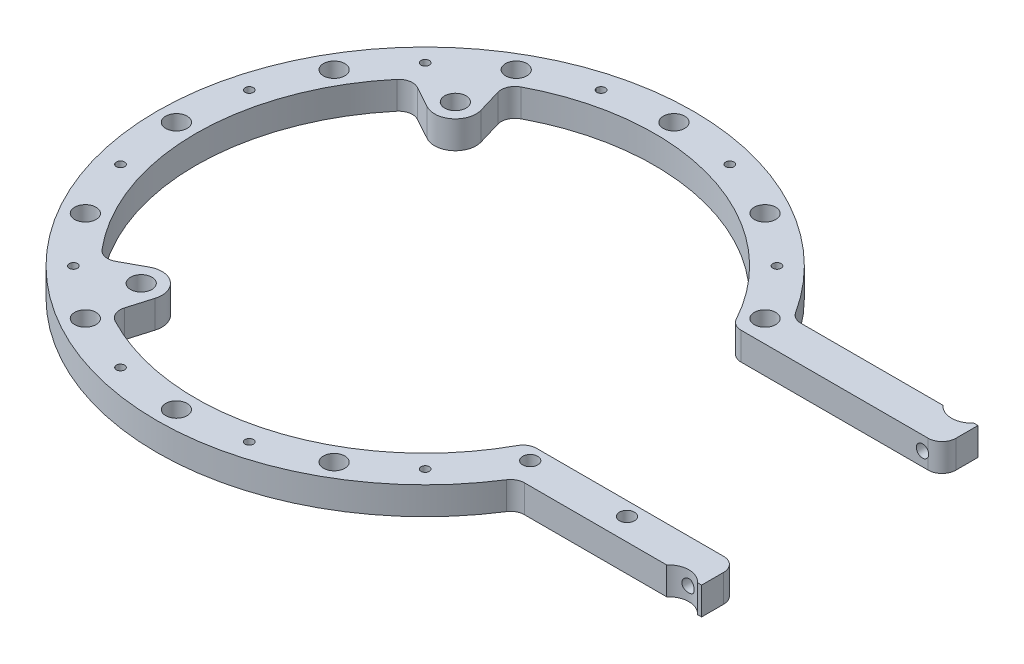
ISO-10303-21;
HEADER;
FILE_DESCRIPTION(('STEP AP214'),'2;1');
FILE_NAME('part.step','',(''),(''),'','','');
FILE_SCHEMA(('AUTOMOTIVE_DESIGN { 1 0 10303 214 1 1 1 1 }'));
ENDSEC;
DATA;
#1=APPLICATION_CONTEXT('core data for automotive mechanical design processes');
#2=APPLICATION_PROTOCOL_DEFINITION('international standard','automotive_design',2000,#1);
#3=PRODUCT_CONTEXT('',#1,'mechanical');
#4=PRODUCT('Part','Part','',(#3));
#5=PRODUCT_RELATED_PRODUCT_CATEGORY('part','',(#4));
#6=PRODUCT_DEFINITION_FORMATION('','',#4);
#7=PRODUCT_DEFINITION_CONTEXT('part definition',#1,'design');
#8=PRODUCT_DEFINITION('design','',#6,#7);
#9=PRODUCT_DEFINITION_SHAPE('','',#8);
#10=(LENGTH_UNIT() NAMED_UNIT(*) SI_UNIT(.MILLI.,.METRE.));
#11=(NAMED_UNIT(*) PLANE_ANGLE_UNIT() SI_UNIT($,.RADIAN.));
#12=(NAMED_UNIT(*) SI_UNIT($,.STERADIAN.) SOLID_ANGLE_UNIT());
#13=UNCERTAINTY_MEASURE_WITH_UNIT(LENGTH_MEASURE(1.E-05),#10,'distance_accuracy_value','');
#14=(GEOMETRIC_REPRESENTATION_CONTEXT(3) GLOBAL_UNCERTAINTY_ASSIGNED_CONTEXT((#13)) GLOBAL_UNIT_ASSIGNED_CONTEXT((#10,
#11,#12)) REPRESENTATION_CONTEXT('',''));
#15=CARTESIAN_POINT('',(0.,0.,0.));
#16=DIRECTION('',(0.,0.,1.));
#17=DIRECTION('',(1.,0.,0.));
#18=AXIS2_PLACEMENT_3D('',#15,#16,#17);
#19=CARTESIAN_POINT('',(92.075,0.,26.67));
#20=DIRECTION('',(0.,-1.,0.));
#21=DIRECTION('',(0.,0.,-1.));
#22=AXIS2_PLACEMENT_3D('',#19,#20,#21);
#23=PLANE('',#22);
#24=CARTESIAN_POINT('',(50.8,0.,26.67));
#25=DIRECTION('',(0.,-1.,0.));
#26=DIRECTION('',(0.,0.,-1.));
#27=AXIS2_PLACEMENT_3D('',#24,#25,#26);
#28=CIRCLE('',#27,1.7272);
#29=CARTESIAN_POINT('',(50.8,0.,24.9428));
#30=VERTEX_POINT('',#29);
#31=EDGE_CURVE('E1315',#30,#30,#28,.T.);
#32=ORIENTED_EDGE('',*,*,#31,.F.);
#33=EDGE_LOOP('',(#32));
#34=FACE_BOUND('',#33,.T.);
#35=CARTESIAN_POINT('',(73.025,0.,26.67));
#36=DIRECTION('',(0.,-1.,0.));
#37=DIRECTION('',(0.,0.,-1.));
#38=AXIS2_PLACEMENT_3D('',#35,#36,#37);
#39=CIRCLE('',#38,1.7272);
#40=CARTESIAN_POINT('',(73.025,0.,24.9428));
#41=VERTEX_POINT('',#40);
#42=EDGE_CURVE('E1309',#41,#41,#39,.T.);
#43=ORIENTED_EDGE('',*,*,#42,.F.);
#44=EDGE_LOOP('',(#43));
#45=FACE_BOUND('',#44,.T.);
#46=CARTESIAN_POINT('',(-14.7915084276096,0.,55.2026609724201));
#47=DIRECTION('',(0.,1.,0.));
#48=DIRECTION('',(0.,0.,1.));
#49=AXIS2_PLACEMENT_3D('',#46,#47,#48);
#50=CIRCLE('',#49,0.952499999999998);
#51=CARTESIAN_POINT('',(-14.7915084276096,0.,56.1551609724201));
#52=VERTEX_POINT('',#51);
#53=EDGE_CURVE('E1294',#52,#52,#50,.T.);
#54=ORIENTED_EDGE('',*,*,#53,.T.);
#55=EDGE_LOOP('',(#54));
#56=FACE_BOUND('',#55,.T.);
#57=CARTESIAN_POINT('',(40.4111525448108,0.,40.4111525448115));
#58=DIRECTION('',(0.,1.,0.));
#59=DIRECTION('',(0.,0.,1.));
#60=AXIS2_PLACEMENT_3D('',#57,#58,#59);
#61=CIRCLE('',#60,0.952499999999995);
#62=CARTESIAN_POINT('',(40.4111525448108,0.,41.3636525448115));
#63=VERTEX_POINT('',#62);
#64=EDGE_CURVE('E1282',#63,#63,#61,.T.);
#65=ORIENTED_EDGE('',*,*,#64,.T.);
#66=EDGE_LOOP('',(#65));
#67=FACE_BOUND('',#66,.T.);
#68=CARTESIAN_POINT('',(14.7915084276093,0.,-55.2026609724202));
#69=DIRECTION('',(0.,1.,0.));
#70=DIRECTION('',(0.,0.,1.));
#71=AXIS2_PLACEMENT_3D('',#68,#69,#70);
#72=CIRCLE('',#71,0.952499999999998);
#73=CARTESIAN_POINT('',(14.7915084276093,0.,-54.2501609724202));
#74=VERTEX_POINT('',#73);
#75=EDGE_CURVE('E1270',#74,#74,#72,.T.);
#76=ORIENTED_EDGE('',*,*,#75,.T.);
#77=EDGE_LOOP('',(#76));
#78=FACE_BOUND('',#77,.T.);
#79=CARTESIAN_POINT('',(-40.4111525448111,0.,-40.4111525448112));
#80=DIRECTION('',(0.,1.,0.));
#81=DIRECTION('',(0.,0.,1.));
#82=AXIS2_PLACEMENT_3D('',#79,#80,#81);
#83=CIRCLE('',#82,0.952499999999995);
#84=CARTESIAN_POINT('',(-40.4111525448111,0.,-39.4586525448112));
#85=VERTEX_POINT('',#84);
#86=EDGE_CURVE('E1258',#85,#85,#83,.T.);
#87=ORIENTED_EDGE('',*,*,#86,.T.);
#88=EDGE_LOOP('',(#87));
#89=FACE_BOUND('',#88,.T.);
#90=CARTESIAN_POINT('',(-29.1521571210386,0.,-36.0854268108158));
#91=DIRECTION('',(0.,1.,0.));
#92=DIRECTION('',(0.,0.,1.));
#93=AXIS2_PLACEMENT_3D('',#90,#91,#92);
#94=CIRCLE('',#93,2.45745);
#95=CARTESIAN_POINT('',(-29.1521571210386,0.,-33.6279768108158));
#96=VERTEX_POINT('',#95);
#97=EDGE_CURVE('E1171',#96,#96,#94,.T.);
#98=ORIENTED_EDGE('',*,*,#97,.T.);
#99=EDGE_LOOP('',(#98));
#100=FACE_BOUND('',#99,.T.);
#101=CARTESIAN_POINT('',(90.7532696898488,0.,-34.9250000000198));
#102=DIRECTION('',(0.,-1.,0.));
#103=DIRECTION('',(0.,0.,-1.));
#104=AXIS2_PLACEMENT_3D('',#101,#102,#103);
#105=CIRCLE('',#104,4.76250000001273);
#106=CARTESIAN_POINT('',(94.3030276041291,0.,-31.75));
#107=VERTEX_POINT('',#106);
#108=CARTESIAN_POINT('',(87.2035117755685,0.,-31.75));
#109=VERTEX_POINT('',#108);
#110=EDGE_CURVE('E54',#107,#109,#105,.T.);
#111=ORIENTED_EDGE('',*,*,#110,.F.);
#112=DIRECTION('',(-1.,0.,0.));
#113=VECTOR('',#112,1.);
#114=CARTESIAN_POINT('',(95.25,0.,-31.75));
#115=LINE('',#114,#113);
#116=CARTESIAN_POINT('',(95.25,0.,-31.75));
#117=VERTEX_POINT('',#116);
#118=EDGE_CURVE('E350',#117,#107,#115,.T.);
#119=ORIENTED_EDGE('',*,*,#118,.F.);
#120=DIRECTION('',(0.,0.,-1.));
#121=VECTOR('',#120,1.);
#122=CARTESIAN_POINT('',(95.25,0.,-31.75));
#123=LINE('',#122,#121);
#124=CARTESIAN_POINT('',(95.25,0.,-26.67));
#125=VERTEX_POINT('',#124);
#126=EDGE_CURVE('E351',#125,#117,#123,.T.);
#127=ORIENTED_EDGE('',*,*,#126,.F.);
#128=CARTESIAN_POINT('',(92.075,0.,-26.67));
#129=DIRECTION('',(0.,1.,0.));
#130=DIRECTION('',(0.,0.,1.));
#131=AXIS2_PLACEMENT_3D('',#128,#129,#130);
#132=CIRCLE('',#131,3.175);
#133=CARTESIAN_POINT('',(92.075,0.,-23.495));
#134=VERTEX_POINT('',#133);
#135=EDGE_CURVE('E353',#134,#125,#132,.T.);
#136=ORIENTED_EDGE('',*,*,#135,.F.);
#137=DIRECTION('',(1.,0.,0.));
#138=VECTOR('',#137,1.);
#139=CARTESIAN_POINT('',(49.1048419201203,0.,-23.495));
#140=LINE('',#139,#138);
#141=CARTESIAN_POINT('',(49.1048419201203,0.,-23.495));
#142=VERTEX_POINT('',#141);
#143=EDGE_CURVE('E458',#142,#134,#140,.T.);
#144=ORIENTED_EDGE('',*,*,#143,.F.);
#145=CARTESIAN_POINT('',(49.1048419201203,0.,-26.67));
#146=DIRECTION('',(0.,1.,0.));
#147=DIRECTION('',(0.,0.,-1.));
#148=AXIS2_PLACEMENT_3D('',#145,#146,#147);
#149=CIRCLE('',#148,3.175);
#150=CARTESIAN_POINT('',(46.3147940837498,0.,-25.1546590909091));
#151=VERTEX_POINT('',#150);
#152=EDGE_CURVE('E456',#151,#142,#149,.T.);
#153=ORIENTED_EDGE('',*,*,#152,.F.);
#154=CARTESIAN_POINT('',(0.,0.,0.));
#155=DIRECTION('',(0.,-1.,0.));
#156=DIRECTION('',(0.,0.,1.));
#157=AXIS2_PLACEMENT_3D('',#154,#155,#156);
#158=CIRCLE('',#157,52.705);
#159=CARTESIAN_POINT('',(-24.6322929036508,0.,-46.594711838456));
#160=VERTEX_POINT('',#159);
#161=EDGE_CURVE('E454',#160,#151,#158,.T.);
#162=ORIENTED_EDGE('',*,*,#161,.F.);
#163=CARTESIAN_POINT('',(-23.1484198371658,0.,-43.7878014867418));
#164=DIRECTION('',(0.,-1.,0.));
#165=DIRECTION('',(0.,0.,1.));
#166=AXIS2_PLACEMENT_3D('',#163,#164,#165);
#167=CIRCLE('',#166,3.175);
#168=CARTESIAN_POINT('',(-26.1937165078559,0.,-42.8895848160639));
#169=VERTEX_POINT('',#168);
#170=EDGE_CURVE('E452',#169,#160,#167,.T.);
#171=ORIENTED_EDGE('',*,*,#170,.F.);
#172=DIRECTION('',(-0.282902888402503,0.,-0.95914855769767));
#173=VECTOR('',#172,1.);
#174=CARTESIAN_POINT('',(-26.1937165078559,0.,-42.8895848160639));
#175=LINE('',#174,#173);
#176=CARTESIAN_POINT('',(-24.5842121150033,0.,-37.4327518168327));
#177=VERTEX_POINT('',#176);
#178=EDGE_CURVE('E450',#177,#169,#175,.T.);
#179=ORIENTED_EDGE('',*,*,#178,.F.);
#180=CARTESIAN_POINT('',(-29.1521571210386,0.,-36.0854268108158));
#181=DIRECTION('',(0.,1.,0.));
#182=DIRECTION('',(0.,0.,-1.));
#183=AXIS2_PLACEMENT_3D('',#180,#181,#182);
#184=CIRCLE('',#183,4.7625000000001);
#185=CARTESIAN_POINT('',(-31.4294793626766,0.,-31.9026992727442));
#186=VERTEX_POINT('',#185);
#187=EDGE_CURVE('E448',#186,#177,#184,.T.);
#188=ORIENTED_EDGE('',*,*,#187,.F.);
#189=DIRECTION('',(0.878263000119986,0.,0.478177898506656));
#190=VECTOR('',#189,1.);
#191=CARTESIAN_POINT('',(-31.4294793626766,0.,-31.9026992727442));
#192=LINE('',#191,#190);
#193=CARTESIAN_POINT('',(-36.426134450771,0.,-34.6231714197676));
#194=VERTEX_POINT('',#193);
#195=EDGE_CURVE('E446',#194,#186,#192,.T.);
#196=ORIENTED_EDGE('',*,*,#195,.F.);
#197=CARTESIAN_POINT('',(-37.9443492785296,0.,-31.8346863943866));
#198=DIRECTION('',(0.,-1.,0.));
#199=DIRECTION('',(0.,0.,-1.));
#200=AXIS2_PLACEMENT_3D('',#197,#198,#199);
#201=CIRCLE('',#200,3.175);
#202=CARTESIAN_POINT('',(-40.3766793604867,0.,-33.8753714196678));
#203=VERTEX_POINT('',#202);
#204=EDGE_CURVE('E444',#203,#194,#201,.T.);
#205=ORIENTED_EDGE('',*,*,#204,.F.);
#206=CARTESIAN_POINT('',(0.,0.,0.));
#207=DIRECTION('',(0.,-1.,0.));
#208=DIRECTION('',(0.,0.,1.));
#209=AXIS2_PLACEMENT_3D('',#206,#207,#208);
#210=CIRCLE('',#209,52.705);
#211=CARTESIAN_POINT('',(-40.3766793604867,0.,33.8753714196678));
#212=VERTEX_POINT('',#211);
#213=EDGE_CURVE('E442',#212,#203,#210,.T.);
#214=ORIENTED_EDGE('',*,*,#213,.F.);
#215=CARTESIAN_POINT('',(-37.9443492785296,0.,31.8346863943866));
#216=DIRECTION('',(0.,-1.,0.));
#217=DIRECTION('',(0.,0.,1.));
#218=AXIS2_PLACEMENT_3D('',#215,#216,#217);
#219=CIRCLE('',#218,3.175);
#220=CARTESIAN_POINT('',(-36.426134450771,0.,34.6231714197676));
#221=VERTEX_POINT('',#220);
#222=EDGE_CURVE('E440',#221,#212,#219,.T.);
#223=ORIENTED_EDGE('',*,*,#222,.F.);
#224=DIRECTION('',(-0.878263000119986,0.,0.478177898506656));
#225=VECTOR('',#224,1.);
#226=CARTESIAN_POINT('',(-31.4294793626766,0.,31.9026992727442));
#227=LINE('',#226,#225);
#228=CARTESIAN_POINT('',(-31.4294793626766,0.,31.9026992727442));
#229=VERTEX_POINT('',#228);
#230=EDGE_CURVE('E438',#229,#221,#227,.T.);
#231=ORIENTED_EDGE('',*,*,#230,.F.);
#232=CARTESIAN_POINT('',(-29.1521571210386,0.,36.0854268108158));
#233=DIRECTION('',(0.,1.,0.));
#234=DIRECTION('',(0.,0.,1.));
#235=AXIS2_PLACEMENT_3D('',#232,#233,#234);
#236=CIRCLE('',#235,4.7625000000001);
#237=CARTESIAN_POINT('',(-24.5842121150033,0.,37.4327518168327));
#238=VERTEX_POINT('',#237);
#239=EDGE_CURVE('E436',#238,#229,#236,.T.);
#240=ORIENTED_EDGE('',*,*,#239,.F.);
#241=DIRECTION('',(0.282902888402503,0.,-0.95914855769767));
#242=VECTOR('',#241,1.);
#243=CARTESIAN_POINT('',(-26.1937165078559,0.,42.8895848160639));
#244=LINE('',#243,#242);
#245=CARTESIAN_POINT('',(-26.1937165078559,0.,42.8895848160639));
#246=VERTEX_POINT('',#245);
#247=EDGE_CURVE('E434',#246,#238,#244,.T.);
#248=ORIENTED_EDGE('',*,*,#247,.F.);
#249=CARTESIAN_POINT('',(-23.1484198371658,0.,43.7878014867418));
#250=DIRECTION('',(0.,-1.,0.));
#251=DIRECTION('',(0.,0.,-1.));
#252=AXIS2_PLACEMENT_3D('',#249,#250,#251);
#253=CIRCLE('',#252,3.175);
#254=CARTESIAN_POINT('',(-24.6322929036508,0.,46.594711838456));
#255=VERTEX_POINT('',#254);
#256=EDGE_CURVE('E432',#255,#246,#253,.T.);
#257=ORIENTED_EDGE('',*,*,#256,.F.);
#258=CARTESIAN_POINT('',(0.,0.,0.));
#259=DIRECTION('',(0.,-1.,0.));
#260=DIRECTION('',(0.,0.,1.));
#261=AXIS2_PLACEMENT_3D('',#258,#259,#260);
#262=CIRCLE('',#261,52.705);
#263=CARTESIAN_POINT('',(46.3147940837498,0.,25.1546590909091));
#264=VERTEX_POINT('',#263);
#265=EDGE_CURVE('E430',#264,#255,#262,.T.);
#266=ORIENTED_EDGE('',*,*,#265,.F.);
#267=CARTESIAN_POINT('',(49.1048419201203,0.,26.67));
#268=DIRECTION('',(0.,1.,0.));
#269=DIRECTION('',(0.,0.,1.));
#270=AXIS2_PLACEMENT_3D('',#267,#268,#269);
#271=CIRCLE('',#270,3.175);
#272=CARTESIAN_POINT('',(49.1048419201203,0.,23.495));
#273=VERTEX_POINT('',#272);
#274=EDGE_CURVE('E427',#273,#264,#271,.T.);
#275=ORIENTED_EDGE('',*,*,#274,.F.);
#276=DIRECTION('',(-1.,0.,0.));
#277=VECTOR('',#276,1.);
#278=CARTESIAN_POINT('',(92.075,0.,23.495));
#279=LINE('',#278,#277);
#280=CARTESIAN_POINT('',(92.075,0.,23.495));
#281=VERTEX_POINT('',#280);
#282=EDGE_CURVE('E425',#281,#273,#279,.T.);
#283=ORIENTED_EDGE('',*,*,#282,.F.);
#284=CARTESIAN_POINT('',(92.075,0.,26.67));
#285=DIRECTION('',(0.,1.,0.));
#286=DIRECTION('',(0.,0.,-1.));
#287=AXIS2_PLACEMENT_3D('',#284,#285,#286);
#288=CIRCLE('',#287,3.175);
#289=CARTESIAN_POINT('',(95.25,0.,26.67));
#290=VERTEX_POINT('',#289);
#291=EDGE_CURVE('E402',#290,#281,#288,.T.);
#292=ORIENTED_EDGE('',*,*,#291,.F.);
#293=DIRECTION('',(0.,0.,-1.));
#294=VECTOR('',#293,1.);
#295=CARTESIAN_POINT('',(95.25,0.,26.67));
#296=LINE('',#295,#294);
#297=CARTESIAN_POINT('',(95.25,0.,31.75));
#298=VERTEX_POINT('',#297);
#299=EDGE_CURVE('E366',#298,#290,#296,.T.);
#300=ORIENTED_EDGE('',*,*,#299,.F.);
#301=DIRECTION('',(1.,0.,0.));
#302=VECTOR('',#301,1.);
#303=CARTESIAN_POINT('',(95.25,0.,31.75));
#304=LINE('',#303,#302);
#305=CARTESIAN_POINT('',(94.3030276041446,0.,31.75));
#306=VERTEX_POINT('',#305);
#307=EDGE_CURVE('E362',#306,#298,#304,.T.);
#308=ORIENTED_EDGE('',*,*,#307,.F.);
#309=CARTESIAN_POINT('',(90.7532696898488,0.,34.9250000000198));
#310=DIRECTION('',(0.,1.,0.));
#311=DIRECTION('',(0.,0.,1.));
#312=AXIS2_PLACEMENT_3D('',#309,#310,#311);
#313=CIRCLE('',#312,4.76250000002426);
#314=CARTESIAN_POINT('',(87.203511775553,0.,31.75));
#315=VERTEX_POINT('',#314);
#316=EDGE_CURVE('E566',#306,#315,#313,.T.);
#317=ORIENTED_EDGE('',*,*,#316,.T.);
#318=CARTESIAN_POINT('',(54.5472022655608,0.,31.75));
#319=VERTEX_POINT('',#318);
#320=EDGE_CURVE('E363',#319,#315,#304,.T.);
#321=ORIENTED_EDGE('',*,*,#320,.F.);
#322=CARTESIAN_POINT('',(54.5472022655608,0.,34.925));
#323=DIRECTION('',(0.,-1.,0.));
#324=DIRECTION('',(0.,0.,1.));
#325=AXIS2_PLACEMENT_3D('',#322,#323,#324);
#326=CIRCLE('',#325,3.17500000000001);
#327=CARTESIAN_POINT('',(51.8733198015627,0.,33.2129901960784));
#328=VERTEX_POINT('',#327);
#329=EDGE_CURVE('E360',#328,#319,#326,.T.);
#330=ORIENTED_EDGE('',*,*,#329,.F.);
#331=CARTESIAN_POINT('',(0.,0.,0.));
#332=DIRECTION('',(0.,1.,0.));
#333=DIRECTION('',(0.,0.,1.));
#334=AXIS2_PLACEMENT_3D('',#331,#332,#333);
#335=CIRCLE('',#334,61.595);
#336=CARTESIAN_POINT('',(51.8733198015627,0.,-33.2129901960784));
#337=VERTEX_POINT('',#336);
#338=EDGE_CURVE('E358',#337,#328,#335,.T.);
#339=ORIENTED_EDGE('',*,*,#338,.F.);
#340=CARTESIAN_POINT('',(54.5472022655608,0.,-34.925));
#341=DIRECTION('',(0.,-1.,0.));
#342=DIRECTION('',(0.,0.,-1.));
#343=AXIS2_PLACEMENT_3D('',#340,#341,#342);
#344=CIRCLE('',#343,3.17500000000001);
#345=CARTESIAN_POINT('',(54.5472022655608,0.,-31.75));
#346=VERTEX_POINT('',#345);
#347=EDGE_CURVE('E349',#346,#337,#344,.T.);
#348=ORIENTED_EDGE('',*,*,#347,.F.);
#349=EDGE_CURVE('E341',#109,#346,#115,.T.);
#350=ORIENTED_EDGE('',*,*,#349,.F.);
#351=EDGE_LOOP('',(#111,#119,#127,#136,#144,#153,#162,#171,#179,#188,#196,#205,#214,#223,#231,
#240,#248,#257,#266,#275,#283,#292,#300,#308,#317,#321,#330,#339,#348,#350));
#352=FACE_BOUND('',#351,.T.);
#353=CARTESIAN_POINT('',(-29.1521571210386,0.,36.0854268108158));
#354=DIRECTION('',(0.,1.,0.));
#355=DIRECTION('',(0.,0.,1.));
#356=AXIS2_PLACEMENT_3D('',#353,#354,#355);
#357=CIRCLE('',#356,2.45745);
#358=CARTESIAN_POINT('',(-29.1521571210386,0.,38.5428768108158));
#359=VERTEX_POINT('',#358);
#360=EDGE_CURVE('E1178',#359,#359,#357,.T.);
#361=ORIENTED_EDGE('',*,*,#360,.T.);
#362=EDGE_LOOP('',(#361));
#363=FACE_BOUND('',#362,.T.);
#364=CARTESIAN_POINT('',(-57.15,0.,0.));
#365=DIRECTION('',(0.,-1.,0.));
#366=DIRECTION('',(0.,0.,-1.));
#367=AXIS2_PLACEMENT_3D('',#364,#365,#366);
#368=CIRCLE('',#367,2.45745);
#369=CARTESIAN_POINT('',(-57.15,0.,-2.45745));
#370=VERTEX_POINT('',#369);
#371=EDGE_CURVE('E1189',#370,#370,#368,.T.);
#372=ORIENTED_EDGE('',*,*,#371,.F.);
#373=EDGE_LOOP('',(#372));
#374=FACE_BOUND('',#373,.T.);
#375=CARTESIAN_POINT('',(-55.2026609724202,0.,14.7915084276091));
#376=DIRECTION('',(0.,1.,0.));
#377=DIRECTION('',(0.,0.,1.));
#378=AXIS2_PLACEMENT_3D('',#375,#376,#377);
#379=CIRCLE('',#378,0.952499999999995);
#380=CARTESIAN_POINT('',(-55.2026609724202,0.,15.7440084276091));
#381=VERTEX_POINT('',#380);
#382=EDGE_CURVE('E1192',#381,#381,#379,.T.);
#383=ORIENTED_EDGE('',*,*,#382,.T.);
#384=EDGE_LOOP('',(#383));
#385=FACE_BOUND('',#384,.T.);
#386=CARTESIAN_POINT('',(-49.4933518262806,0.,-28.575));
#387=DIRECTION('',(0.,-1.,0.));
#388=DIRECTION('',(0.,0.,-1.));
#389=AXIS2_PLACEMENT_3D('',#386,#387,#388);
#390=CIRCLE('',#389,2.45745);
#391=CARTESIAN_POINT('',(-49.4933518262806,0.,-31.03245));
#392=VERTEX_POINT('',#391);
#393=EDGE_CURVE('E1201',#392,#392,#390,.T.);
#394=ORIENTED_EDGE('',*,*,#393,.F.);
#395=EDGE_LOOP('',(#394));
#396=FACE_BOUND('',#395,.T.);
#397=CARTESIAN_POINT('',(-28.5749999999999,0.,-49.4933518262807));
#398=DIRECTION('',(0.,-1.,0.));
#399=DIRECTION('',(0.,0.,-1.));
#400=AXIS2_PLACEMENT_3D('',#397,#398,#399);
#401=CIRCLE('',#400,2.45745);
#402=CARTESIAN_POINT('',(-28.5749999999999,0.,-51.9508018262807));
#403=VERTEX_POINT('',#402);
#404=EDGE_CURVE('E1207',#403,#403,#401,.T.);
#405=ORIENTED_EDGE('',*,*,#404,.F.);
#406=EDGE_LOOP('',(#405));
#407=FACE_BOUND('',#406,.T.);
#408=CARTESIAN_POINT('',(1.98993803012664E-13,0.,-57.15));
#409=DIRECTION('',(0.,-1.,0.));
#410=DIRECTION('',(0.,0.,-1.));
#411=AXIS2_PLACEMENT_3D('',#408,#409,#410);
#412=CIRCLE('',#411,2.45745);
#413=CARTESIAN_POINT('',(1.98993803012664E-13,0.,-59.60745));
#414=VERTEX_POINT('',#413);
#415=EDGE_CURVE('E1213',#414,#414,#412,.T.);
#416=ORIENTED_EDGE('',*,*,#415,.F.);
#417=EDGE_LOOP('',(#416));
#418=FACE_BOUND('',#417,.T.);
#419=CARTESIAN_POINT('',(28.5750000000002,0.,-49.4933518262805));
#420=DIRECTION('',(0.,-1.,0.));
#421=DIRECTION('',(0.,0.,-1.));
#422=AXIS2_PLACEMENT_3D('',#419,#420,#421);
#423=CIRCLE('',#422,2.45745);
#424=CARTESIAN_POINT('',(28.5750000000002,0.,-51.9508018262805));
#425=VERTEX_POINT('',#424);
#426=EDGE_CURVE('E1219',#425,#425,#423,.T.);
#427=ORIENTED_EDGE('',*,*,#426,.F.);
#428=EDGE_LOOP('',(#427));
#429=FACE_BOUND('',#428,.T.);
#430=CARTESIAN_POINT('',(49.4933518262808,0.,-28.5749999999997));
#431=DIRECTION('',(0.,-1.,0.));
#432=DIRECTION('',(0.,0.,-1.));
#433=AXIS2_PLACEMENT_3D('',#430,#431,#432);
#434=CIRCLE('',#433,2.45745);
#435=CARTESIAN_POINT('',(49.4933518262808,0.,-31.0324499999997));
#436=VERTEX_POINT('',#435);
#437=EDGE_CURVE('E1225',#436,#436,#434,.T.);
#438=ORIENTED_EDGE('',*,*,#437,.F.);
#439=EDGE_LOOP('',(#438));
#440=FACE_BOUND('',#439,.T.);
#441=CARTESIAN_POINT('',(28.5749999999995,0.,49.4933518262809));
#442=DIRECTION('',(0.,-1.,0.));
#443=DIRECTION('',(0.,0.,-1.));
#444=AXIS2_PLACEMENT_3D('',#441,#442,#443);
#445=CIRCLE('',#444,2.45745);
#446=CARTESIAN_POINT('',(28.5749999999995,0.,47.0359018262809));
#447=VERTEX_POINT('',#446);
#448=EDGE_CURVE('E1231',#447,#447,#445,.T.);
#449=ORIENTED_EDGE('',*,*,#448,.F.);
#450=EDGE_LOOP('',(#449));
#451=FACE_BOUND('',#450,.T.);
#452=CARTESIAN_POINT('',(-5.98070120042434E-13,0.,57.15));
#453=DIRECTION('',(0.,-1.,0.));
#454=DIRECTION('',(0.,0.,-1.));
#455=AXIS2_PLACEMENT_3D('',#452,#453,#454);
#456=CIRCLE('',#455,2.45745);
#457=CARTESIAN_POINT('',(-5.98070120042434E-13,0.,54.69255));
#458=VERTEX_POINT('',#457);
#459=EDGE_CURVE('E1237',#458,#458,#456,.T.);
#460=ORIENTED_EDGE('',*,*,#459,.F.);
#461=EDGE_LOOP('',(#460));
#462=FACE_BOUND('',#461,.T.);
#463=CARTESIAN_POINT('',(-28.5750000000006,0.,49.4933518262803));
#464=DIRECTION('',(0.,-1.,0.));
#465=DIRECTION('',(0.,0.,-1.));
#466=AXIS2_PLACEMENT_3D('',#463,#464,#465);
#467=CIRCLE('',#466,2.45745);
#468=CARTESIAN_POINT('',(-28.5750000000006,0.,47.0359018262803));
#469=VERTEX_POINT('',#468);
#470=EDGE_CURVE('E1243',#469,#469,#467,.T.);
#471=ORIENTED_EDGE('',*,*,#470,.F.);
#472=EDGE_LOOP('',(#471));
#473=FACE_BOUND('',#472,.T.);
#474=CARTESIAN_POINT('',(-49.493351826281,0.,28.5749999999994));
#475=DIRECTION('',(0.,-1.,0.));
#476=DIRECTION('',(0.,0.,-1.));
#477=AXIS2_PLACEMENT_3D('',#474,#475,#476);
#478=CIRCLE('',#477,2.45745);
#479=CARTESIAN_POINT('',(-49.493351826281,0.,26.1175499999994));
#480=VERTEX_POINT('',#479);
#481=EDGE_CURVE('E1249',#480,#480,#478,.T.);
#482=ORIENTED_EDGE('',*,*,#481,.F.);
#483=EDGE_LOOP('',(#482));
#484=FACE_BOUND('',#483,.T.);
#485=CARTESIAN_POINT('',(-55.2026609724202,0.,-14.7915084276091));
#486=DIRECTION('',(0.,1.,0.));
#487=DIRECTION('',(0.,0.,1.));
#488=AXIS2_PLACEMENT_3D('',#485,#486,#487);
#489=CIRCLE('',#488,0.952499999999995);
#490=CARTESIAN_POINT('',(-55.2026609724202,0.,-13.8390084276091));
#491=VERTEX_POINT('',#490);
#492=EDGE_CURVE('E1252',#491,#491,#489,.T.);
#493=ORIENTED_EDGE('',*,*,#492,.T.);
#494=EDGE_LOOP('',(#493));
#495=FACE_BOUND('',#494,.T.);
#496=CARTESIAN_POINT('',(-14.7915084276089,0.,-55.2026609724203));
#497=DIRECTION('',(0.,1.,0.));
#498=DIRECTION('',(0.,0.,1.));
#499=AXIS2_PLACEMENT_3D('',#496,#497,#498);
#500=CIRCLE('',#499,0.952499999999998);
#501=CARTESIAN_POINT('',(-14.7915084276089,0.,-54.2501609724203));
#502=VERTEX_POINT('',#501);
#503=EDGE_CURVE('E1264',#502,#502,#500,.T.);
#504=ORIENTED_EDGE('',*,*,#503,.T.);
#505=EDGE_LOOP('',(#504));
#506=FACE_BOUND('',#505,.T.);
#507=CARTESIAN_POINT('',(40.4111525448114,0.,-40.411152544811));
#508=DIRECTION('',(0.,1.,0.));
#509=DIRECTION('',(0.,0.,1.));
#510=AXIS2_PLACEMENT_3D('',#507,#508,#509);
#511=CIRCLE('',#510,0.952499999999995);
#512=CARTESIAN_POINT('',(40.4111525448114,0.,-39.458652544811));
#513=VERTEX_POINT('',#512);
#514=EDGE_CURVE('E1276',#513,#513,#511,.T.);
#515=ORIENTED_EDGE('',*,*,#514,.T.);
#516=EDGE_LOOP('',(#515));
#517=FACE_BOUND('',#516,.T.);
#518=CARTESIAN_POINT('',(14.7915084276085,0.,55.2026609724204));
#519=DIRECTION('',(0.,1.,0.));
#520=DIRECTION('',(0.,0.,1.));
#521=AXIS2_PLACEMENT_3D('',#518,#519,#520);
#522=CIRCLE('',#521,0.952499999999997);
#523=CARTESIAN_POINT('',(14.7915084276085,0.,56.1551609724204));
#524=VERTEX_POINT('',#523);
#525=EDGE_CURVE('E1288',#524,#524,#522,.T.);
#526=ORIENTED_EDGE('',*,*,#525,.T.);
#527=EDGE_LOOP('',(#526));
#528=FACE_BOUND('',#527,.T.);
#529=CARTESIAN_POINT('',(-40.4111525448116,0.,40.4111525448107));
#530=DIRECTION('',(0.,1.,0.));
#531=DIRECTION('',(0.,0.,1.));
#532=AXIS2_PLACEMENT_3D('',#529,#530,#531);
#533=CIRCLE('',#532,0.952499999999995);
#534=CARTESIAN_POINT('',(-40.4111525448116,0.,41.3636525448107));
#535=VERTEX_POINT('',#534);
#536=EDGE_CURVE('E1300',#535,#535,#533,.T.);
#537=ORIENTED_EDGE('',*,*,#536,.T.);
#538=EDGE_LOOP('',(#537));
#539=FACE_BOUND('',#538,.T.);
#540=ADVANCED_FACE('F39',(#34,#45,#56,#67,#78,#89,#100,#352,#363,#374,#385,#396,#407,#418,#429,
#440,#451,#462,#473,#484,#495,#506,#517,#528,#539),#23,.T.);
#541=CARTESIAN_POINT('',(92.075,6.35,26.67));
#542=DIRECTION('',(0.,-1.,0.));
#543=DIRECTION('',(0.,0.,-1.));
#544=AXIS2_PLACEMENT_3D('',#541,#542,#543);
#545=PLANE('',#544);
#546=CARTESIAN_POINT('',(50.8,6.35,26.67));
#547=DIRECTION('',(0.,-1.,0.));
#548=DIRECTION('',(0.,0.,-1.));
#549=AXIS2_PLACEMENT_3D('',#546,#547,#548);
#550=CIRCLE('',#549,1.7272);
#551=CARTESIAN_POINT('',(50.8,6.35,24.9428));
#552=VERTEX_POINT('',#551);
#553=EDGE_CURVE('E1312',#552,#552,#550,.T.);
#554=ORIENTED_EDGE('',*,*,#553,.T.);
#555=EDGE_LOOP('',(#554));
#556=FACE_BOUND('',#555,.T.);
#557=CARTESIAN_POINT('',(73.025,6.35,26.67));
#558=DIRECTION('',(0.,-1.,0.));
#559=DIRECTION('',(0.,0.,-1.));
#560=AXIS2_PLACEMENT_3D('',#557,#558,#559);
#561=CIRCLE('',#560,1.7272);
#562=CARTESIAN_POINT('',(73.025,6.35,24.9428));
#563=VERTEX_POINT('',#562);
#564=EDGE_CURVE('E1306',#563,#563,#561,.T.);
#565=ORIENTED_EDGE('',*,*,#564,.T.);
#566=EDGE_LOOP('',(#565));
#567=FACE_BOUND('',#566,.T.);
#568=CARTESIAN_POINT('',(-49.493351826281,6.35,28.5749999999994));
#569=DIRECTION('',(0.,-1.,0.));
#570=DIRECTION('',(0.,0.,-1.));
#571=AXIS2_PLACEMENT_3D('',#568,#569,#570);
#572=CIRCLE('',#571,2.45745);
#573=CARTESIAN_POINT('',(-49.493351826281,6.35,26.1175499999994));
#574=VERTEX_POINT('',#573);
#575=EDGE_CURVE('E1246',#574,#574,#572,.T.);
#576=ORIENTED_EDGE('',*,*,#575,.T.);
#577=EDGE_LOOP('',(#576));
#578=FACE_BOUND('',#577,.T.);
#579=CARTESIAN_POINT('',(-28.5750000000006,6.35,49.4933518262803));
#580=DIRECTION('',(0.,-1.,0.));
#581=DIRECTION('',(0.,0.,-1.));
#582=AXIS2_PLACEMENT_3D('',#579,#580,#581);
#583=CIRCLE('',#582,2.45745);
#584=CARTESIAN_POINT('',(-28.5750000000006,6.35,47.0359018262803));
#585=VERTEX_POINT('',#584);
#586=EDGE_CURVE('E1240',#585,#585,#583,.T.);
#587=ORIENTED_EDGE('',*,*,#586,.T.);
#588=EDGE_LOOP('',(#587));
#589=FACE_BOUND('',#588,.T.);
#590=CARTESIAN_POINT('',(-5.98070120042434E-13,6.35,57.15));
#591=DIRECTION('',(0.,-1.,0.));
#592=DIRECTION('',(0.,0.,-1.));
#593=AXIS2_PLACEMENT_3D('',#590,#591,#592);
#594=CIRCLE('',#593,2.45745);
#595=CARTESIAN_POINT('',(-5.98070120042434E-13,6.35,54.69255));
#596=VERTEX_POINT('',#595);
#597=EDGE_CURVE('E1234',#596,#596,#594,.T.);
#598=ORIENTED_EDGE('',*,*,#597,.T.);
#599=EDGE_LOOP('',(#598));
#600=FACE_BOUND('',#599,.T.);
#601=CARTESIAN_POINT('',(28.5749999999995,6.35,49.4933518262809));
#602=DIRECTION('',(0.,-1.,0.));
#603=DIRECTION('',(0.,0.,-1.));
#604=AXIS2_PLACEMENT_3D('',#601,#602,#603);
#605=CIRCLE('',#604,2.45745);
#606=CARTESIAN_POINT('',(28.5749999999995,6.35,47.0359018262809));
#607=VERTEX_POINT('',#606);
#608=EDGE_CURVE('E1228',#607,#607,#605,.T.);
#609=ORIENTED_EDGE('',*,*,#608,.T.);
#610=EDGE_LOOP('',(#609));
#611=FACE_BOUND('',#610,.T.);
#612=CARTESIAN_POINT('',(49.4933518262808,6.35,-28.5749999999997));
#613=DIRECTION('',(0.,-1.,0.));
#614=DIRECTION('',(0.,0.,-1.));
#615=AXIS2_PLACEMENT_3D('',#612,#613,#614);
#616=CIRCLE('',#615,2.45745);
#617=CARTESIAN_POINT('',(49.4933518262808,6.35,-31.0324499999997));
#618=VERTEX_POINT('',#617);
#619=EDGE_CURVE('E1222',#618,#618,#616,.T.);
#620=ORIENTED_EDGE('',*,*,#619,.T.);
#621=EDGE_LOOP('',(#620));
#622=FACE_BOUND('',#621,.T.);
#623=CARTESIAN_POINT('',(28.5750000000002,6.35,-49.4933518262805));
#624=DIRECTION('',(0.,-1.,0.));
#625=DIRECTION('',(0.,0.,-1.));
#626=AXIS2_PLACEMENT_3D('',#623,#624,#625);
#627=CIRCLE('',#626,2.45745);
#628=CARTESIAN_POINT('',(28.5750000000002,6.35,-51.9508018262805));
#629=VERTEX_POINT('',#628);
#630=EDGE_CURVE('E1216',#629,#629,#627,.T.);
#631=ORIENTED_EDGE('',*,*,#630,.T.);
#632=EDGE_LOOP('',(#631));
#633=FACE_BOUND('',#632,.T.);
#634=CARTESIAN_POINT('',(1.98993803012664E-13,6.35,-57.15));
#635=DIRECTION('',(0.,-1.,0.));
#636=DIRECTION('',(0.,0.,-1.));
#637=AXIS2_PLACEMENT_3D('',#634,#635,#636);
#638=CIRCLE('',#637,2.45745);
#639=CARTESIAN_POINT('',(1.98993803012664E-13,6.35,-59.60745));
#640=VERTEX_POINT('',#639);
#641=EDGE_CURVE('E1210',#640,#640,#638,.T.);
#642=ORIENTED_EDGE('',*,*,#641,.T.);
#643=EDGE_LOOP('',(#642));
#644=FACE_BOUND('',#643,.T.);
#645=CARTESIAN_POINT('',(-28.5749999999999,6.35,-49.4933518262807));
#646=DIRECTION('',(0.,-1.,0.));
#647=DIRECTION('',(0.,0.,-1.));
#648=AXIS2_PLACEMENT_3D('',#645,#646,#647);
#649=CIRCLE('',#648,2.45745);
#650=CARTESIAN_POINT('',(-28.5749999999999,6.35,-51.9508018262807));
#651=VERTEX_POINT('',#650);
#652=EDGE_CURVE('E1204',#651,#651,#649,.T.);
#653=ORIENTED_EDGE('',*,*,#652,.T.);
#654=EDGE_LOOP('',(#653));
#655=FACE_BOUND('',#654,.T.);
#656=CARTESIAN_POINT('',(-49.4933518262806,6.35,-28.575));
#657=DIRECTION('',(0.,-1.,0.));
#658=DIRECTION('',(0.,0.,-1.));
#659=AXIS2_PLACEMENT_3D('',#656,#657,#658);
#660=CIRCLE('',#659,2.45745);
#661=CARTESIAN_POINT('',(-49.4933518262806,6.35,-31.03245));
#662=VERTEX_POINT('',#661);
#663=EDGE_CURVE('E1198',#662,#662,#660,.T.);
#664=ORIENTED_EDGE('',*,*,#663,.T.);
#665=EDGE_LOOP('',(#664));
#666=FACE_BOUND('',#665,.T.);
#667=CARTESIAN_POINT('',(-55.2026609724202,6.35,14.7915084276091));
#668=DIRECTION('',(0.,1.,0.));
#669=DIRECTION('',(0.,0.,1.));
#670=AXIS2_PLACEMENT_3D('',#667,#668,#669);
#671=CIRCLE('',#670,0.952500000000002);
#672=CARTESIAN_POINT('',(-55.2026609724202,6.35,15.7440084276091));
#673=VERTEX_POINT('',#672);
#674=EDGE_CURVE('E1195',#673,#673,#671,.T.);
#675=ORIENTED_EDGE('',*,*,#674,.F.);
#676=EDGE_LOOP('',(#675));
#677=FACE_BOUND('',#676,.T.);
#678=CARTESIAN_POINT('',(-57.15,6.35,0.));
#679=DIRECTION('',(0.,-1.,0.));
#680=DIRECTION('',(0.,0.,-1.));
#681=AXIS2_PLACEMENT_3D('',#678,#679,#680);
#682=CIRCLE('',#681,2.45745);
#683=CARTESIAN_POINT('',(-57.15,6.35,-2.45745));
#684=VERTEX_POINT('',#683);
#685=EDGE_CURVE('E1186',#684,#684,#682,.T.);
#686=ORIENTED_EDGE('',*,*,#685,.T.);
#687=EDGE_LOOP('',(#686));
#688=FACE_BOUND('',#687,.T.);
#689=CARTESIAN_POINT('',(-29.1521571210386,6.35,36.0854268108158));
#690=DIRECTION('',(0.,1.,0.));
#691=DIRECTION('',(0.,0.,1.));
#692=AXIS2_PLACEMENT_3D('',#689,#690,#691);
#693=CIRCLE('',#692,2.45745);
#694=CARTESIAN_POINT('',(-29.1521571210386,6.35,38.5428768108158));
#695=VERTEX_POINT('',#694);
#696=EDGE_CURVE('E1183',#695,#695,#693,.T.);
#697=ORIENTED_EDGE('',*,*,#696,.F.);
#698=EDGE_LOOP('',(#697));
#699=FACE_BOUND('',#698,.T.);
#700=DIRECTION('',(-1.,0.,0.));
#701=VECTOR('',#700,1.);
#702=CARTESIAN_POINT('',(95.25,6.35,-31.75));
#703=LINE('',#702,#701);
#704=CARTESIAN_POINT('',(95.25,6.35,-31.75));
#705=VERTEX_POINT('',#704);
#706=CARTESIAN_POINT('',(94.3030276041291,6.35,-31.75));
#707=VERTEX_POINT('',#706);
#708=EDGE_CURVE('E401',#705,#707,#703,.T.);
#709=ORIENTED_EDGE('',*,*,#708,.T.);
#710=CARTESIAN_POINT('',(90.7532696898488,6.35,-34.9250000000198));
#711=DIRECTION('',(0.,1.,0.));
#712=DIRECTION('',(0.,0.,1.));
#713=AXIS2_PLACEMENT_3D('',#710,#711,#712);
#714=CIRCLE('',#713,4.76250000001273);
#715=CARTESIAN_POINT('',(87.2035117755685,6.35,-31.75));
#716=VERTEX_POINT('',#715);
#717=EDGE_CURVE('E407',#716,#707,#714,.T.);
#718=ORIENTED_EDGE('',*,*,#717,.F.);
#719=CARTESIAN_POINT('',(54.5472022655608,6.35,-31.75));
#720=VERTEX_POINT('',#719);
#721=EDGE_CURVE('E343',#716,#720,#703,.T.);
#722=ORIENTED_EDGE('',*,*,#721,.T.);
#723=CARTESIAN_POINT('',(54.5472022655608,6.35,-34.925));
#724=DIRECTION('',(0.,-1.,0.));
#725=DIRECTION('',(0.,0.,-1.));
#726=AXIS2_PLACEMENT_3D('',#723,#724,#725);
#727=CIRCLE('',#726,3.17500000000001);
#728=CARTESIAN_POINT('',(51.8733198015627,6.35,-33.2129901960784));
#729=VERTEX_POINT('',#728);
#730=EDGE_CURVE('E408',#720,#729,#727,.T.);
#731=ORIENTED_EDGE('',*,*,#730,.T.);
#732=CARTESIAN_POINT('',(0.,6.35,0.));
#733=DIRECTION('',(0.,1.,0.));
#734=DIRECTION('',(0.,0.,1.));
#735=AXIS2_PLACEMENT_3D('',#732,#733,#734);
#736=CIRCLE('',#735,61.595);
#737=CARTESIAN_POINT('',(51.8733198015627,6.35,33.2129901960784));
#738=VERTEX_POINT('',#737);
#739=EDGE_CURVE('E410',#729,#738,#736,.T.);
#740=ORIENTED_EDGE('',*,*,#739,.T.);
#741=CARTESIAN_POINT('',(54.5472022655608,6.35,34.925));
#742=DIRECTION('',(0.,-1.,0.));
#743=DIRECTION('',(0.,0.,1.));
#744=AXIS2_PLACEMENT_3D('',#741,#742,#743);
#745=CIRCLE('',#744,3.17500000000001);
#746=CARTESIAN_POINT('',(54.5472022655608,6.35,31.75));
#747=VERTEX_POINT('',#746);
#748=EDGE_CURVE('E416',#738,#747,#745,.T.);
#749=ORIENTED_EDGE('',*,*,#748,.T.);
#750=DIRECTION('',(1.,0.,0.));
#751=VECTOR('',#750,1.);
#752=CARTESIAN_POINT('',(95.25,6.35,31.75));
#753=LINE('',#752,#751);
#754=CARTESIAN_POINT('',(87.203511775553,6.35,31.75));
#755=VERTEX_POINT('',#754);
#756=EDGE_CURVE('E419',#747,#755,#753,.T.);
#757=ORIENTED_EDGE('',*,*,#756,.T.);
#758=CARTESIAN_POINT('',(90.7532696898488,6.35,34.9250000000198));
#759=DIRECTION('',(0.,1.,0.));
#760=DIRECTION('',(0.,0.,1.));
#761=AXIS2_PLACEMENT_3D('',#758,#759,#760);
#762=CIRCLE('',#761,4.76250000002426);
#763=CARTESIAN_POINT('',(94.3030276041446,6.35,31.75));
#764=VERTEX_POINT('',#763);
#765=EDGE_CURVE('E579',#764,#755,#762,.T.);
#766=ORIENTED_EDGE('',*,*,#765,.F.);
#767=CARTESIAN_POINT('',(95.25,6.35,31.75));
#768=VERTEX_POINT('',#767);
#769=EDGE_CURVE('E418',#764,#768,#753,.T.);
#770=ORIENTED_EDGE('',*,*,#769,.T.);
#771=DIRECTION('',(0.,0.,-1.));
#772=VECTOR('',#771,1.);
#773=CARTESIAN_POINT('',(95.25,6.35,26.67));
#774=LINE('',#773,#772);
#775=CARTESIAN_POINT('',(95.25,6.35,26.67));
#776=VERTEX_POINT('',#775);
#777=EDGE_CURVE('E373',#768,#776,#774,.T.);
#778=ORIENTED_EDGE('',*,*,#777,.T.);
#779=CARTESIAN_POINT('',(92.075,6.35,26.67));
#780=DIRECTION('',(0.,1.,0.));
#781=DIRECTION('',(0.,0.,-1.));
#782=AXIS2_PLACEMENT_3D('',#779,#780,#781);
#783=CIRCLE('',#782,3.175);
#784=CARTESIAN_POINT('',(92.075,6.35,23.495));
#785=VERTEX_POINT('',#784);
#786=EDGE_CURVE('E368',#776,#785,#783,.T.);
#787=ORIENTED_EDGE('',*,*,#786,.T.);
#788=DIRECTION('',(-1.,0.,0.));
#789=VECTOR('',#788,1.);
#790=CARTESIAN_POINT('',(92.075,6.35,23.495));
#791=LINE('',#790,#789);
#792=CARTESIAN_POINT('',(49.1048419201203,6.35,23.495));
#793=VERTEX_POINT('',#792);
#794=EDGE_CURVE('E583',#785,#793,#791,.T.);
#795=ORIENTED_EDGE('',*,*,#794,.T.);
#796=CARTESIAN_POINT('',(49.1048419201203,6.35,26.67));
#797=DIRECTION('',(0.,1.,0.));
#798=DIRECTION('',(0.,0.,1.));
#799=AXIS2_PLACEMENT_3D('',#796,#797,#798);
#800=CIRCLE('',#799,3.175);
#801=CARTESIAN_POINT('',(46.3147940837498,6.35,25.1546590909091));
#802=VERTEX_POINT('',#801);
#803=EDGE_CURVE('E547',#793,#802,#800,.T.);
#804=ORIENTED_EDGE('',*,*,#803,.T.);
#805=CARTESIAN_POINT('',(0.,6.35,0.));
#806=DIRECTION('',(0.,-1.,0.));
#807=DIRECTION('',(0.,0.,1.));
#808=AXIS2_PLACEMENT_3D('',#805,#806,#807);
#809=CIRCLE('',#808,52.705);
#810=CARTESIAN_POINT('',(-24.6322929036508,6.35,46.594711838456));
#811=VERTEX_POINT('',#810);
#812=EDGE_CURVE('E542',#802,#811,#809,.T.);
#813=ORIENTED_EDGE('',*,*,#812,.T.);
#814=CARTESIAN_POINT('',(-23.1484198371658,6.35,43.7878014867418));
#815=DIRECTION('',(0.,-1.,0.));
#816=DIRECTION('',(0.,0.,-1.));
#817=AXIS2_PLACEMENT_3D('',#814,#815,#816);
#818=CIRCLE('',#817,3.175);
#819=CARTESIAN_POINT('',(-26.1937165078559,6.35,42.8895848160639));
#820=VERTEX_POINT('',#819);
#821=EDGE_CURVE('E538',#811,#820,#818,.T.);
#822=ORIENTED_EDGE('',*,*,#821,.T.);
#823=DIRECTION('',(0.282902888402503,0.,-0.95914855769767));
#824=VECTOR('',#823,1.);
#825=CARTESIAN_POINT('',(-26.1937165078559,6.35,42.8895848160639));
#826=LINE('',#825,#824);
#827=CARTESIAN_POINT('',(-24.5842121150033,6.35,37.4327518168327));
#828=VERTEX_POINT('',#827);
#829=EDGE_CURVE('E530',#820,#828,#826,.T.);
#830=ORIENTED_EDGE('',*,*,#829,.T.);
#831=CARTESIAN_POINT('',(-29.1521571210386,6.35,36.0854268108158));
#832=DIRECTION('',(0.,1.,0.));
#833=DIRECTION('',(0.,0.,1.));
#834=AXIS2_PLACEMENT_3D('',#831,#832,#833);
#835=CIRCLE('',#834,4.7625000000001);
#836=CARTESIAN_POINT('',(-31.4294793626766,6.35,31.9026992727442));
#837=VERTEX_POINT('',#836);
#838=EDGE_CURVE('E525',#828,#837,#835,.T.);
#839=ORIENTED_EDGE('',*,*,#838,.T.);
#840=DIRECTION('',(-0.878263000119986,0.,0.478177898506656));
#841=VECTOR('',#840,1.);
#842=CARTESIAN_POINT('',(-31.4294793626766,6.35,31.9026992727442));
#843=LINE('',#842,#841);
#844=CARTESIAN_POINT('',(-36.426134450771,6.35,34.6231714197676));
#845=VERTEX_POINT('',#844);
#846=EDGE_CURVE('E521',#837,#845,#843,.T.);
#847=ORIENTED_EDGE('',*,*,#846,.T.);
#848=CARTESIAN_POINT('',(-37.9443492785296,6.35,31.8346863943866));
#849=DIRECTION('',(0.,-1.,0.));
#850=DIRECTION('',(0.,0.,1.));
#851=AXIS2_PLACEMENT_3D('',#848,#849,#850);
#852=CIRCLE('',#851,3.175);
#853=CARTESIAN_POINT('',(-40.3766793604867,6.35,33.8753714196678));
#854=VERTEX_POINT('',#853);
#855=EDGE_CURVE('E512',#845,#854,#852,.T.);
#856=ORIENTED_EDGE('',*,*,#855,.T.);
#857=CARTESIAN_POINT('',(0.,6.35,0.));
#858=DIRECTION('',(0.,-1.,0.));
#859=DIRECTION('',(0.,0.,1.));
#860=AXIS2_PLACEMENT_3D('',#857,#858,#859);
#861=CIRCLE('',#860,52.705);
#862=CARTESIAN_POINT('',(-40.3766793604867,6.35,-33.8753714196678));
#863=VERTEX_POINT('',#862);
#864=EDGE_CURVE('E507',#854,#863,#861,.T.);
#865=ORIENTED_EDGE('',*,*,#864,.T.);
#866=CARTESIAN_POINT('',(-37.9443492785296,6.35,-31.8346863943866));
#867=DIRECTION('',(0.,-1.,0.));
#868=DIRECTION('',(0.,0.,-1.));
#869=AXIS2_PLACEMENT_3D('',#866,#867,#868);
#870=CIRCLE('',#869,3.175);
#871=CARTESIAN_POINT('',(-36.426134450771,6.35,-34.6231714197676));
#872=VERTEX_POINT('',#871);
#873=EDGE_CURVE('E503',#863,#872,#870,.T.);
#874=ORIENTED_EDGE('',*,*,#873,.T.);
#875=DIRECTION('',(0.878263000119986,0.,0.478177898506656));
#876=VECTOR('',#875,1.);
#877=CARTESIAN_POINT('',(-31.4294793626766,6.35,-31.9026992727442));
#878=LINE('',#877,#876);
#879=CARTESIAN_POINT('',(-31.4294793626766,6.35,-31.9026992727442));
#880=VERTEX_POINT('',#879);
#881=EDGE_CURVE('E494',#872,#880,#878,.T.);
#882=ORIENTED_EDGE('',*,*,#881,.T.);
#883=CARTESIAN_POINT('',(-29.1521571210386,6.35,-36.0854268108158));
#884=DIRECTION('',(0.,1.,0.));
#885=DIRECTION('',(0.,0.,-1.));
#886=AXIS2_PLACEMENT_3D('',#883,#884,#885);
#887=CIRCLE('',#886,4.7625000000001);
#888=CARTESIAN_POINT('',(-24.5842121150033,6.35,-37.4327518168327));
#889=VERTEX_POINT('',#888);
#890=EDGE_CURVE('E489',#880,#889,#887,.T.);
#891=ORIENTED_EDGE('',*,*,#890,.T.);
#892=DIRECTION('',(-0.282902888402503,0.,-0.95914855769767));
#893=VECTOR('',#892,1.);
#894=CARTESIAN_POINT('',(-26.1937165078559,6.35,-42.8895848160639));
#895=LINE('',#894,#893);
#896=CARTESIAN_POINT('',(-26.1937165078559,6.35,-42.8895848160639));
#897=VERTEX_POINT('',#896);
#898=EDGE_CURVE('E485',#889,#897,#895,.T.);
#899=ORIENTED_EDGE('',*,*,#898,.T.);
#900=CARTESIAN_POINT('',(-23.1484198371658,6.35,-43.7878014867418));
#901=DIRECTION('',(0.,-1.,0.));
#902=DIRECTION('',(0.,0.,1.));
#903=AXIS2_PLACEMENT_3D('',#900,#901,#902);
#904=CIRCLE('',#903,3.175);
#905=CARTESIAN_POINT('',(-24.6322929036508,6.35,-46.594711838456));
#906=VERTEX_POINT('',#905);
#907=EDGE_CURVE('E476',#897,#906,#904,.T.);
#908=ORIENTED_EDGE('',*,*,#907,.T.);
#909=CARTESIAN_POINT('',(0.,6.35,0.));
#910=DIRECTION('',(0.,-1.,0.));
#911=DIRECTION('',(0.,0.,1.));
#912=AXIS2_PLACEMENT_3D('',#909,#910,#911);
#913=CIRCLE('',#912,52.705);
#914=CARTESIAN_POINT('',(46.3147940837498,6.35,-25.1546590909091));
#915=VERTEX_POINT('',#914);
#916=EDGE_CURVE('E471',#906,#915,#913,.T.);
#917=ORIENTED_EDGE('',*,*,#916,.T.);
#918=CARTESIAN_POINT('',(49.1048419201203,6.35,-26.67));
#919=DIRECTION('',(0.,1.,0.));
#920=DIRECTION('',(0.,0.,-1.));
#921=AXIS2_PLACEMENT_3D('',#918,#919,#920);
#922=CIRCLE('',#921,3.175);
#923=CARTESIAN_POINT('',(49.1048419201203,6.35,-23.495));
#924=VERTEX_POINT('',#923);
#925=EDGE_CURVE('E467',#915,#924,#922,.T.);
#926=ORIENTED_EDGE('',*,*,#925,.T.);
#927=DIRECTION('',(1.,0.,0.));
#928=VECTOR('',#927,1.);
#929=CARTESIAN_POINT('',(49.1048419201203,6.35,-23.495));
#930=LINE('',#929,#928);
#931=CARTESIAN_POINT('',(92.075,6.35,-23.495));
#932=VERTEX_POINT('',#931);
#933=EDGE_CURVE('E600',#924,#932,#930,.T.);
#934=ORIENTED_EDGE('',*,*,#933,.T.);
#935=CARTESIAN_POINT('',(92.075,6.35,-26.67));
#936=DIRECTION('',(0.,1.,0.));
#937=DIRECTION('',(0.,0.,1.));
#938=AXIS2_PLACEMENT_3D('',#935,#936,#937);
#939=CIRCLE('',#938,3.175);
#940=CARTESIAN_POINT('',(95.25,6.35,-26.67));
#941=VERTEX_POINT('',#940);
#942=EDGE_CURVE('E268',#932,#941,#939,.T.);
#943=ORIENTED_EDGE('',*,*,#942,.T.);
#944=DIRECTION('',(0.,0.,-1.));
#945=VECTOR('',#944,1.);
#946=CARTESIAN_POINT('',(95.25,6.35,-31.75));
#947=LINE('',#946,#945);
#948=EDGE_CURVE('E396',#941,#705,#947,.T.);
#949=ORIENTED_EDGE('',*,*,#948,.T.);
#950=EDGE_LOOP('',(#709,#718,#722,#731,#740,#749,#757,#766,#770,#778,#787,#795,#804,#813,#822,
#830,#839,#847,#856,#865,#874,#882,#891,#899,#908,#917,#926,#934,#943,#949));
#951=FACE_BOUND('',#950,.T.);
#952=CARTESIAN_POINT('',(-29.1521571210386,6.35,-36.0854268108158));
#953=DIRECTION('',(0.,1.,0.));
#954=DIRECTION('',(0.,0.,1.));
#955=AXIS2_PLACEMENT_3D('',#952,#953,#954);
#956=CIRCLE('',#955,2.45745);
#957=CARTESIAN_POINT('',(-29.1521571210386,6.35,-33.6279768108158));
#958=VERTEX_POINT('',#957);
#959=EDGE_CURVE('E1173',#958,#958,#956,.T.);
#960=ORIENTED_EDGE('',*,*,#959,.F.);
#961=EDGE_LOOP('',(#960));
#962=FACE_BOUND('',#961,.T.);
#963=CARTESIAN_POINT('',(-55.2026609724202,6.35,-14.7915084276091));
#964=DIRECTION('',(0.,1.,0.));
#965=DIRECTION('',(0.,0.,1.));
#966=AXIS2_PLACEMENT_3D('',#963,#964,#965);
#967=CIRCLE('',#966,0.952500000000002);
#968=CARTESIAN_POINT('',(-55.2026609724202,6.35,-13.8390084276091));
#969=VERTEX_POINT('',#968);
#970=EDGE_CURVE('E1255',#969,#969,#967,.T.);
#971=ORIENTED_EDGE('',*,*,#970,.F.);
#972=EDGE_LOOP('',(#971));
#973=FACE_BOUND('',#972,.T.);
#974=CARTESIAN_POINT('',(-40.4111525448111,6.35,-40.4111525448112));
#975=DIRECTION('',(0.,1.,0.));
#976=DIRECTION('',(0.,0.,1.));
#977=AXIS2_PLACEMENT_3D('',#974,#975,#976);
#978=CIRCLE('',#977,0.952500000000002);
#979=CARTESIAN_POINT('',(-40.4111525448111,6.35,-39.4586525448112));
#980=VERTEX_POINT('',#979);
#981=EDGE_CURVE('E1261',#980,#980,#978,.T.);
#982=ORIENTED_EDGE('',*,*,#981,.F.);
#983=EDGE_LOOP('',(#982));
#984=FACE_BOUND('',#983,.T.);
#985=CARTESIAN_POINT('',(-14.7915084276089,6.35,-55.2026609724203));
#986=DIRECTION('',(0.,1.,0.));
#987=DIRECTION('',(0.,0.,1.));
#988=AXIS2_PLACEMENT_3D('',#985,#986,#987);
#989=CIRCLE('',#988,0.952499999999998);
#990=CARTESIAN_POINT('',(-14.7915084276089,6.35,-54.2501609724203));
#991=VERTEX_POINT('',#990);
#992=EDGE_CURVE('E1267',#991,#991,#989,.T.);
#993=ORIENTED_EDGE('',*,*,#992,.F.);
#994=EDGE_LOOP('',(#993));
#995=FACE_BOUND('',#994,.T.);
#996=CARTESIAN_POINT('',(14.7915084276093,6.35,-55.2026609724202));
#997=DIRECTION('',(0.,1.,0.));
#998=DIRECTION('',(0.,0.,1.));
#999=AXIS2_PLACEMENT_3D('',#996,#997,#998);
#1000=CIRCLE('',#999,0.952499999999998);
#1001=CARTESIAN_POINT('',(14.7915084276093,6.35,-54.2501609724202));
#1002=VERTEX_POINT('',#1001);
#1003=EDGE_CURVE('E1273',#1002,#1002,#1000,.T.);
#1004=ORIENTED_EDGE('',*,*,#1003,.F.);
#1005=EDGE_LOOP('',(#1004));
#1006=FACE_BOUND('',#1005,.T.);
#1007=CARTESIAN_POINT('',(40.4111525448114,6.35,-40.411152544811));
#1008=DIRECTION('',(0.,1.,0.));
#1009=DIRECTION('',(0.,0.,1.));
#1010=AXIS2_PLACEMENT_3D('',#1007,#1008,#1009);
#1011=CIRCLE('',#1010,0.952500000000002);
#1012=CARTESIAN_POINT('',(40.4111525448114,6.35,-39.458652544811));
#1013=VERTEX_POINT('',#1012);
#1014=EDGE_CURVE('E1279',#1013,#1013,#1011,.T.);
#1015=ORIENTED_EDGE('',*,*,#1014,.F.);
#1016=EDGE_LOOP('',(#1015));
#1017=FACE_BOUND('',#1016,.T.);
#1018=CARTESIAN_POINT('',(40.4111525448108,6.35,40.4111525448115));
#1019=DIRECTION('',(0.,1.,0.));
#1020=DIRECTION('',(0.,0.,1.));
#1021=AXIS2_PLACEMENT_3D('',#1018,#1019,#1020);
#1022=CIRCLE('',#1021,0.952500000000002);
#1023=CARTESIAN_POINT('',(40.4111525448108,6.35,41.3636525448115));
#1024=VERTEX_POINT('',#1023);
#1025=EDGE_CURVE('E1285',#1024,#1024,#1022,.T.);
#1026=ORIENTED_EDGE('',*,*,#1025,.F.);
#1027=EDGE_LOOP('',(#1026));
#1028=FACE_BOUND('',#1027,.T.);
#1029=CARTESIAN_POINT('',(14.7915084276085,6.35,55.2026609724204));
#1030=DIRECTION('',(0.,1.,0.));
#1031=DIRECTION('',(0.,0.,1.));
#1032=AXIS2_PLACEMENT_3D('',#1029,#1030,#1031);
#1033=CIRCLE('',#1032,0.9525);
#1034=CARTESIAN_POINT('',(14.7915084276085,6.35,56.1551609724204));
#1035=VERTEX_POINT('',#1034);
#1036=EDGE_CURVE('E1291',#1035,#1035,#1033,.T.);
#1037=ORIENTED_EDGE('',*,*,#1036,.F.);
#1038=EDGE_LOOP('',(#1037));
#1039=FACE_BOUND('',#1038,.T.);
#1040=CARTESIAN_POINT('',(-14.7915084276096,6.35,55.2026609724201));
#1041=DIRECTION('',(0.,1.,0.));
#1042=DIRECTION('',(0.,0.,1.));
#1043=AXIS2_PLACEMENT_3D('',#1040,#1041,#1042);
#1044=CIRCLE('',#1043,0.952499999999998);
#1045=CARTESIAN_POINT('',(-14.7915084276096,6.35,56.1551609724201));
#1046=VERTEX_POINT('',#1045);
#1047=EDGE_CURVE('E1297',#1046,#1046,#1044,.T.);
#1048=ORIENTED_EDGE('',*,*,#1047,.F.);
#1049=EDGE_LOOP('',(#1048));
#1050=FACE_BOUND('',#1049,.T.);
#1051=CARTESIAN_POINT('',(-40.4111525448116,6.35,40.4111525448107));
#1052=DIRECTION('',(0.,1.,0.));
#1053=DIRECTION('',(0.,0.,1.));
#1054=AXIS2_PLACEMENT_3D('',#1051,#1052,#1053);
#1055=CIRCLE('',#1054,0.952500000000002);
#1056=CARTESIAN_POINT('',(-40.4111525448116,6.35,41.3636525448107));
#1057=VERTEX_POINT('',#1056);
#1058=EDGE_CURVE('E1303',#1057,#1057,#1055,.T.);
#1059=ORIENTED_EDGE('',*,*,#1058,.F.);
#1060=EDGE_LOOP('',(#1059));
#1061=FACE_BOUND('',#1060,.T.);
#1062=ADVANCED_FACE('F405',(#556,#567,#578,#589,#600,#611,#622,#633,#644,#655,#666,#677,#688,
#699,#951,#962,#973,#984,#995,#1006,#1017,#1028,#1039,#1050,#1061),#545,.F.);
#1063=CARTESIAN_POINT('',(95.25,6.35,-31.75));
#1064=DIRECTION('',(0.,0.,1.));
#1065=DIRECTION('',(1.,0.,0.));
#1066=AXIS2_PLACEMENT_3D('',#1063,#1064,#1065);
#1067=PLANE('',#1066);
#1068=ORIENTED_EDGE('',*,*,#118,.T.);
#1069=DIRECTION('',(0.,1.,0.));
#1070=VECTOR('',#1069,1.);
#1071=CARTESIAN_POINT('',(94.3030276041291,0.,-31.75));
#1072=LINE('',#1071,#1070);
#1073=EDGE_CURVE('E332',#107,#707,#1072,.T.);
#1074=ORIENTED_EDGE('',*,*,#1073,.T.);
#1075=ORIENTED_EDGE('',*,*,#708,.F.);
#1076=DIRECTION('',(0.,-1.,0.));
#1077=VECTOR('',#1076,1.);
#1078=CARTESIAN_POINT('',(95.25,6.35,-31.75));
#1079=LINE('',#1078,#1077);
#1080=EDGE_CURVE('E386',#705,#117,#1079,.T.);
#1081=ORIENTED_EDGE('',*,*,#1080,.T.);
#1082=EDGE_LOOP('',(#1068,#1074,#1075,#1081));
#1083=FACE_BOUND('',#1082,.T.);
#1084=ADVANCED_FACE('F399',(#1083),#1067,.F.);
#1085=CARTESIAN_POINT('',(95.25,6.35,31.75));
#1086=DIRECTION('',(0.,0.,-1.));
#1087=DIRECTION('',(-1.,0.,0.));
#1088=AXIS2_PLACEMENT_3D('',#1085,#1086,#1087);
#1089=PLANE('',#1088);
#1090=ORIENTED_EDGE('',*,*,#320,.T.);
#1091=DIRECTION('',(0.,1.,0.));
#1092=VECTOR('',#1091,1.);
#1093=CARTESIAN_POINT('',(87.203511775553,0.,31.75));
#1094=LINE('',#1093,#1092);
#1095=EDGE_CURVE('E344',#315,#755,#1094,.T.);
#1096=ORIENTED_EDGE('',*,*,#1095,.T.);
#1097=ORIENTED_EDGE('',*,*,#756,.F.);
#1098=DIRECTION('',(0.,-1.,0.));
#1099=VECTOR('',#1098,1.);
#1100=CARTESIAN_POINT('',(54.5472022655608,6.35,31.75));
#1101=LINE('',#1100,#1099);
#1102=EDGE_CURVE('E376',#747,#319,#1101,.T.);
#1103=ORIENTED_EDGE('',*,*,#1102,.T.);
#1104=EDGE_LOOP('',(#1090,#1096,#1097,#1103));
#1105=FACE_BOUND('',#1104,.T.);
#1106=ADVANCED_FACE('F608',(#1105),#1089,.F.);
#1107=CARTESIAN_POINT('',(92.075,6.35,26.67));
#1108=DIRECTION('',(0.,-1.,0.));
#1109=DIRECTION('',(0.,0.,-1.));
#1110=AXIS2_PLACEMENT_3D('',#1107,#1108,#1109);
#1111=CYLINDRICAL_SURFACE('',#1110,3.175);
#1112=DIRECTION('',(0.,-1.,0.));
#1113=VECTOR('',#1112,1.);
#1114=CARTESIAN_POINT('',(92.075,6.35,23.495));
#1115=LINE('',#1114,#1113);
#1116=CARTESIAN_POINT('',(92.075,2.64940438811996,23.495));
#1117=VERTEX_POINT('',#1116);
#1118=EDGE_CURVE('E322',#1117,#281,#1115,.T.);
#1119=ORIENTED_EDGE('',*,*,#1118,.F.);
#1120=CARTESIAN_POINT('',(92.075,2.64940438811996,23.495));
#1121=CARTESIAN_POINT('',(92.0897716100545,2.68655268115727,23.4950031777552));
#1122=CARTESIAN_POINT('',(92.1029697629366,2.72430507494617,23.4951025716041));
#1123=CARTESIAN_POINT('',(92.1261440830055,2.80078564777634,23.4953902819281));
#1124=CARTESIAN_POINT('',(92.1361202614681,2.83951382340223,23.495578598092));
#1125=CARTESIAN_POINT('',(92.1611062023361,2.95682710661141,23.4961217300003));
#1126=CARTESIAN_POINT('',(92.171168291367,3.03652816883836,23.4964546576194));
#1127=CARTESIAN_POINT('',(92.1777646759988,3.19648570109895,23.4966621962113));
#1128=CARTESIAN_POINT('',(92.1742898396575,3.27674250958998,23.4965364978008));
#1129=CARTESIAN_POINT('',(92.1539039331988,3.4354088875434,23.4959642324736));
#1130=CARTESIAN_POINT('',(92.1370250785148,3.51382242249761,23.4955184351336));
#1131=CARTESIAN_POINT('',(92.1080375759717,3.60883148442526,23.4951672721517));
#1132=CARTESIAN_POINT('',(92.1019552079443,3.62738440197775,23.4951080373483));
#1133=CARTESIAN_POINT('',(92.0890392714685,3.66420354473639,23.4950242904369));
#1134=CARTESIAN_POINT('',(92.082206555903,3.68247006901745,23.4949997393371));
#1135=CARTESIAN_POINT('',(92.075,3.70059561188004,23.495));
#1136=B_SPLINE_CURVE_WITH_KNOTS('',3,(#1120,#1121,#1122,#1123,#1124,#1125,#1126,#1127,#1128,
#1129,#1130,#1131,#1132,#1133,#1134,#1135),.UNSPECIFIED.,.F.,.F.,(4,2,2,2,2,2,2,4),(0.,
0.119857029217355,0.239713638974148,0.47946765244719,0.719383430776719,0.958724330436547,
1.0172887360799,1.07578725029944),.UNSPECIFIED.);
#1137=CARTESIAN_POINT('',(92.075,3.70059561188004,23.495));
#1138=VERTEX_POINT('',#1137);
#1139=EDGE_CURVE('E1319',#1117,#1138,#1136,.T.);
#1140=ORIENTED_EDGE('',*,*,#1139,.T.);
#1141=EDGE_CURVE('E323',#785,#1138,#1115,.T.);
#1142=ORIENTED_EDGE('',*,*,#1141,.F.);
#1143=ORIENTED_EDGE('',*,*,#786,.F.);
#1144=DIRECTION('',(0.,-1.,0.));
#1145=VECTOR('',#1144,1.);
#1146=CARTESIAN_POINT('',(95.25,6.35,26.67));
#1147=LINE('',#1146,#1145);
#1148=EDGE_CURVE('E369',#776,#290,#1147,.T.);
#1149=ORIENTED_EDGE('',*,*,#1148,.T.);
#1150=ORIENTED_EDGE('',*,*,#291,.T.);
#1151=EDGE_LOOP('',(#1119,#1140,#1142,#1143,#1149,#1150));
#1152=FACE_BOUND('',#1151,.T.);
#1153=ADVANCED_FACE('F41',(#1152),#1111,.T.);
#1154=CARTESIAN_POINT('',(92.075,6.35,23.495));
#1155=DIRECTION('',(0.,0.,1.));
#1156=DIRECTION('',(1.,0.,0.));
#1157=AXIS2_PLACEMENT_3D('',#1154,#1155,#1156);
#1158=PLANE('',#1157);
#1159=ORIENTED_EDGE('',*,*,#1141,.T.);
#1160=CARTESIAN_POINT('',(90.7532696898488,3.175,23.495));
#1161=DIRECTION('',(0.,0.,1.));
#1162=DIRECTION('',(1.,0.,0.));
#1163=AXIS2_PLACEMENT_3D('',#1160,#1161,#1162);
#1164=CIRCLE('',#1163,1.42239999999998);
#1165=EDGE_CURVE('E60',#1138,#1117,#1164,.T.);
#1166=ORIENTED_EDGE('',*,*,#1165,.T.);
#1167=ORIENTED_EDGE('',*,*,#1118,.T.);
#1168=ORIENTED_EDGE('',*,*,#282,.T.);
#1169=DIRECTION('',(0.,-1.,0.));
#1170=VECTOR('',#1169,1.);
#1171=CARTESIAN_POINT('',(49.1048419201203,6.35,23.495));
#1172=LINE('',#1171,#1170);
#1173=EDGE_CURVE('E319',#793,#273,#1172,.T.);
#1174=ORIENTED_EDGE('',*,*,#1173,.F.);
#1175=ORIENTED_EDGE('',*,*,#794,.F.);
#1176=EDGE_LOOP('',(#1159,#1166,#1167,#1168,#1174,#1175));
#1177=FACE_BOUND('',#1176,.T.);
#1178=ADVANCED_FACE('F601',(#1177),#1158,.F.);
#1179=CARTESIAN_POINT('',(49.1048419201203,6.35,26.67));
#1180=DIRECTION('',(0.,-1.,0.));
#1181=DIRECTION('',(0.,0.,-1.));
#1182=AXIS2_PLACEMENT_3D('',#1179,#1180,#1181);
#1183=CYLINDRICAL_SURFACE('',#1182,3.175);
#1184=ORIENTED_EDGE('',*,*,#274,.T.);
#1185=DIRECTION('',(0.,-1.,0.));
#1186=VECTOR('',#1185,1.);
#1187=CARTESIAN_POINT('',(46.3147940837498,6.35,25.1546590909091));
#1188=LINE('',#1187,#1186);
#1189=EDGE_CURVE('E316',#802,#264,#1188,.T.);
#1190=ORIENTED_EDGE('',*,*,#1189,.F.);
#1191=ORIENTED_EDGE('',*,*,#803,.F.);
#1192=ORIENTED_EDGE('',*,*,#1173,.T.);
#1193=EDGE_LOOP('',(#1184,#1190,#1191,#1192));
#1194=FACE_BOUND('',#1193,.T.);
#1195=ADVANCED_FACE('F546',(#1194),#1183,.T.);
#1196=CARTESIAN_POINT('',(0.,6.35,0.));
#1197=DIRECTION('',(0.,-1.,0.));
#1198=DIRECTION('',(0.,0.,-1.));
#1199=AXIS2_PLACEMENT_3D('',#1196,#1197,#1198);
#1200=CYLINDRICAL_SURFACE('',#1199,52.705);
#1201=ORIENTED_EDGE('',*,*,#265,.T.);
#1202=DIRECTION('',(0.,-1.,0.));
#1203=VECTOR('',#1202,1.);
#1204=CARTESIAN_POINT('',(-24.6322929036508,6.35,46.594711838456));
#1205=LINE('',#1204,#1203);
#1206=EDGE_CURVE('E313',#811,#255,#1205,.T.);
#1207=ORIENTED_EDGE('',*,*,#1206,.F.);
#1208=ORIENTED_EDGE('',*,*,#812,.F.);
#1209=ORIENTED_EDGE('',*,*,#1189,.T.);
#1210=EDGE_LOOP('',(#1201,#1207,#1208,#1209));
#1211=FACE_BOUND('',#1210,.T.);
#1212=ADVANCED_FACE('F541',(#1211),#1200,.F.);
#1213=CARTESIAN_POINT('',(-23.1484198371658,6.35,43.7878014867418));
#1214=DIRECTION('',(0.,-1.,0.));
#1215=DIRECTION('',(0.,0.,-1.));
#1216=AXIS2_PLACEMENT_3D('',#1213,#1214,#1215);
#1217=CYLINDRICAL_SURFACE('',#1216,3.175);
#1218=ORIENTED_EDGE('',*,*,#256,.T.);
#1219=DIRECTION('',(0.,-1.,0.));
#1220=VECTOR('',#1219,1.);
#1221=CARTESIAN_POINT('',(-26.1937165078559,6.35,42.8895848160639));
#1222=LINE('',#1221,#1220);
#1223=EDGE_CURVE('E310',#820,#246,#1222,.T.);
#1224=ORIENTED_EDGE('',*,*,#1223,.F.);
#1225=ORIENTED_EDGE('',*,*,#821,.F.);
#1226=ORIENTED_EDGE('',*,*,#1206,.T.);
#1227=EDGE_LOOP('',(#1218,#1224,#1225,#1226));
#1228=FACE_BOUND('',#1227,.T.);
#1229=ADVANCED_FACE('F535',(#1228),#1217,.F.);
#1230=CARTESIAN_POINT('',(-26.1937165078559,6.35,42.8895848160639));
#1231=DIRECTION('',(-0.95914855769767,0.,-0.282902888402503));
#1232=DIRECTION('',(-0.282902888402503,0.,0.95914855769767));
#1233=AXIS2_PLACEMENT_3D('',#1230,#1231,#1232);
#1234=PLANE('',#1233);
#1235=ORIENTED_EDGE('',*,*,#247,.T.);
#1236=DIRECTION('',(0.,-1.,0.));
#1237=VECTOR('',#1236,1.);
#1238=CARTESIAN_POINT('',(-24.5842121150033,6.35,37.4327518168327));
#1239=LINE('',#1238,#1237);
#1240=EDGE_CURVE('E307',#828,#238,#1239,.T.);
#1241=ORIENTED_EDGE('',*,*,#1240,.F.);
#1242=ORIENTED_EDGE('',*,*,#829,.F.);
#1243=ORIENTED_EDGE('',*,*,#1223,.T.);
#1244=EDGE_LOOP('',(#1235,#1241,#1242,#1243));
#1245=FACE_BOUND('',#1244,.T.);
#1246=ADVANCED_FACE('F529',(#1245),#1234,.F.);
#1247=CARTESIAN_POINT('',(-29.1521571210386,6.35,36.0854268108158));
#1248=DIRECTION('',(0.,-1.,0.));
#1249=DIRECTION('',(0.,0.,-1.));
#1250=AXIS2_PLACEMENT_3D('',#1247,#1248,#1249);
#1251=CYLINDRICAL_SURFACE('',#1250,4.7625000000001);
#1252=ORIENTED_EDGE('',*,*,#239,.T.);
#1253=DIRECTION('',(0.,-1.,0.));
#1254=VECTOR('',#1253,1.);
#1255=CARTESIAN_POINT('',(-31.4294793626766,6.35,31.9026992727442));
#1256=LINE('',#1255,#1254);
#1257=EDGE_CURVE('E304',#837,#229,#1256,.T.);
#1258=ORIENTED_EDGE('',*,*,#1257,.F.);
#1259=ORIENTED_EDGE('',*,*,#838,.F.);
#1260=ORIENTED_EDGE('',*,*,#1240,.T.);
#1261=EDGE_LOOP('',(#1252,#1258,#1259,#1260));
#1262=FACE_BOUND('',#1261,.T.);
#1263=ADVANCED_FACE('F524',(#1262),#1251,.T.);
#1264=CARTESIAN_POINT('',(-31.4294793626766,6.35,31.9026992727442));
#1265=DIRECTION('',(0.478177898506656,0.,0.878263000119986));
#1266=DIRECTION('',(0.878263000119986,0.,-0.478177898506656));
#1267=AXIS2_PLACEMENT_3D('',#1264,#1265,#1266);
#1268=PLANE('',#1267);
#1269=ORIENTED_EDGE('',*,*,#230,.T.);
#1270=DIRECTION('',(0.,-1.,0.));
#1271=VECTOR('',#1270,1.);
#1272=CARTESIAN_POINT('',(-36.426134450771,6.35,34.6231714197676));
#1273=LINE('',#1272,#1271);
#1274=EDGE_CURVE('E301',#845,#221,#1273,.T.);
#1275=ORIENTED_EDGE('',*,*,#1274,.F.);
#1276=ORIENTED_EDGE('',*,*,#846,.F.);
#1277=ORIENTED_EDGE('',*,*,#1257,.T.);
#1278=EDGE_LOOP('',(#1269,#1275,#1276,#1277));
#1279=FACE_BOUND('',#1278,.T.);
#1280=ADVANCED_FACE('F518',(#1279),#1268,.F.);
#1281=CARTESIAN_POINT('',(-37.9443492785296,6.35,31.8346863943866));
#1282=DIRECTION('',(0.,-1.,0.));
#1283=DIRECTION('',(0.,0.,-1.));
#1284=AXIS2_PLACEMENT_3D('',#1281,#1282,#1283);
#1285=CYLINDRICAL_SURFACE('',#1284,3.175);
#1286=ORIENTED_EDGE('',*,*,#222,.T.);
#1287=DIRECTION('',(0.,-1.,0.));
#1288=VECTOR('',#1287,1.);
#1289=CARTESIAN_POINT('',(-40.3766793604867,6.35,33.8753714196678));
#1290=LINE('',#1289,#1288);
#1291=EDGE_CURVE('E298',#854,#212,#1290,.T.);
#1292=ORIENTED_EDGE('',*,*,#1291,.F.);
#1293=ORIENTED_EDGE('',*,*,#855,.F.);
#1294=ORIENTED_EDGE('',*,*,#1274,.T.);
#1295=EDGE_LOOP('',(#1286,#1292,#1293,#1294));
#1296=FACE_BOUND('',#1295,.T.);
#1297=ADVANCED_FACE('F511',(#1296),#1285,.F.);
#1298=CARTESIAN_POINT('',(0.,6.35,0.));
#1299=DIRECTION('',(0.,-1.,0.));
#1300=DIRECTION('',(0.,0.,-1.));
#1301=AXIS2_PLACEMENT_3D('',#1298,#1299,#1300);
#1302=CYLINDRICAL_SURFACE('',#1301,52.705);
#1303=ORIENTED_EDGE('',*,*,#213,.T.);
#1304=DIRECTION('',(0.,-1.,0.));
#1305=VECTOR('',#1304,1.);
#1306=CARTESIAN_POINT('',(-40.3766793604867,6.35,-33.8753714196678));
#1307=LINE('',#1306,#1305);
#1308=EDGE_CURVE('E295',#863,#203,#1307,.T.);
#1309=ORIENTED_EDGE('',*,*,#1308,.F.);
#1310=ORIENTED_EDGE('',*,*,#864,.F.);
#1311=ORIENTED_EDGE('',*,*,#1291,.T.);
#1312=EDGE_LOOP('',(#1303,#1309,#1310,#1311));
#1313=FACE_BOUND('',#1312,.T.);
#1314=ADVANCED_FACE('F506',(#1313),#1302,.F.);
#1315=CARTESIAN_POINT('',(-37.9443492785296,6.35,-31.8346863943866));
#1316=DIRECTION('',(0.,-1.,0.));
#1317=DIRECTION('',(0.,0.,-1.));
#1318=AXIS2_PLACEMENT_3D('',#1315,#1316,#1317);
#1319=CYLINDRICAL_SURFACE('',#1318,3.175);
#1320=ORIENTED_EDGE('',*,*,#204,.T.);
#1321=DIRECTION('',(0.,-1.,0.));
#1322=VECTOR('',#1321,1.);
#1323=CARTESIAN_POINT('',(-36.426134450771,6.35,-34.6231714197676));
#1324=LINE('',#1323,#1322);
#1325=EDGE_CURVE('E292',#872,#194,#1324,.T.);
#1326=ORIENTED_EDGE('',*,*,#1325,.F.);
#1327=ORIENTED_EDGE('',*,*,#873,.F.);
#1328=ORIENTED_EDGE('',*,*,#1308,.T.);
#1329=EDGE_LOOP('',(#1320,#1326,#1327,#1328));
#1330=FACE_BOUND('',#1329,.T.);
#1331=ADVANCED_FACE('F500',(#1330),#1319,.F.);
#1332=CARTESIAN_POINT('',(-31.4294793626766,6.35,-31.9026992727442));
#1333=DIRECTION('',(0.478177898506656,0.,-0.878263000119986));
#1334=DIRECTION('',(-0.878263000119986,0.,-0.478177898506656));
#1335=AXIS2_PLACEMENT_3D('',#1332,#1333,#1334);
#1336=PLANE('',#1335);
#1337=ORIENTED_EDGE('',*,*,#195,.T.);
#1338=DIRECTION('',(0.,-1.,0.));
#1339=VECTOR('',#1338,1.);
#1340=CARTESIAN_POINT('',(-31.4294793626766,6.35,-31.9026992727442));
#1341=LINE('',#1340,#1339);
#1342=EDGE_CURVE('E289',#880,#186,#1341,.T.);
#1343=ORIENTED_EDGE('',*,*,#1342,.F.);
#1344=ORIENTED_EDGE('',*,*,#881,.F.);
#1345=ORIENTED_EDGE('',*,*,#1325,.T.);
#1346=EDGE_LOOP('',(#1337,#1343,#1344,#1345));
#1347=FACE_BOUND('',#1346,.T.);
#1348=ADVANCED_FACE('F493',(#1347),#1336,.F.);
#1349=CARTESIAN_POINT('',(-29.1521571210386,6.35,-36.0854268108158));
#1350=DIRECTION('',(0.,-1.,0.));
#1351=DIRECTION('',(0.,0.,-1.));
#1352=AXIS2_PLACEMENT_3D('',#1349,#1350,#1351);
#1353=CYLINDRICAL_SURFACE('',#1352,4.7625000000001);
#1354=ORIENTED_EDGE('',*,*,#187,.T.);
#1355=DIRECTION('',(0.,-1.,0.));
#1356=VECTOR('',#1355,1.);
#1357=CARTESIAN_POINT('',(-24.5842121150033,6.35,-37.4327518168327));
#1358=LINE('',#1357,#1356);
#1359=EDGE_CURVE('E286',#889,#177,#1358,.T.);
#1360=ORIENTED_EDGE('',*,*,#1359,.F.);
#1361=ORIENTED_EDGE('',*,*,#890,.F.);
#1362=ORIENTED_EDGE('',*,*,#1342,.T.);
#1363=EDGE_LOOP('',(#1354,#1360,#1361,#1362));
#1364=FACE_BOUND('',#1363,.T.);
#1365=ADVANCED_FACE('F488',(#1364),#1353,.T.);
#1366=CARTESIAN_POINT('',(-26.1937165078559,6.35,-42.8895848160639));
#1367=DIRECTION('',(-0.95914855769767,0.,0.282902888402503));
#1368=DIRECTION('',(0.282902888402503,0.,0.95914855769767));
#1369=AXIS2_PLACEMENT_3D('',#1366,#1367,#1368);
#1370=PLANE('',#1369);
#1371=ORIENTED_EDGE('',*,*,#178,.T.);
#1372=DIRECTION('',(0.,-1.,0.));
#1373=VECTOR('',#1372,1.);
#1374=CARTESIAN_POINT('',(-26.1937165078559,6.35,-42.8895848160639));
#1375=LINE('',#1374,#1373);
#1376=EDGE_CURVE('E283',#897,#169,#1375,.T.);
#1377=ORIENTED_EDGE('',*,*,#1376,.F.);
#1378=ORIENTED_EDGE('',*,*,#898,.F.);
#1379=ORIENTED_EDGE('',*,*,#1359,.T.);
#1380=EDGE_LOOP('',(#1371,#1377,#1378,#1379));
#1381=FACE_BOUND('',#1380,.T.);
#1382=ADVANCED_FACE('F482',(#1381),#1370,.F.);
#1383=CARTESIAN_POINT('',(-23.1484198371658,6.35,-43.7878014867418));
#1384=DIRECTION('',(0.,-1.,0.));
#1385=DIRECTION('',(0.,0.,-1.));
#1386=AXIS2_PLACEMENT_3D('',#1383,#1384,#1385);
#1387=CYLINDRICAL_SURFACE('',#1386,3.175);
#1388=ORIENTED_EDGE('',*,*,#170,.T.);
#1389=DIRECTION('',(0.,-1.,0.));
#1390=VECTOR('',#1389,1.);
#1391=CARTESIAN_POINT('',(-24.6322929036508,6.35,-46.594711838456));
#1392=LINE('',#1391,#1390);
#1393=EDGE_CURVE('E280',#906,#160,#1392,.T.);
#1394=ORIENTED_EDGE('',*,*,#1393,.F.);
#1395=ORIENTED_EDGE('',*,*,#907,.F.);
#1396=ORIENTED_EDGE('',*,*,#1376,.T.);
#1397=EDGE_LOOP('',(#1388,#1394,#1395,#1396));
#1398=FACE_BOUND('',#1397,.T.);
#1399=ADVANCED_FACE('F475',(#1398),#1387,.F.);
#1400=CARTESIAN_POINT('',(0.,6.35,0.));
#1401=DIRECTION('',(0.,-1.,0.));
#1402=DIRECTION('',(0.,0.,-1.));
#1403=AXIS2_PLACEMENT_3D('',#1400,#1401,#1402);
#1404=CYLINDRICAL_SURFACE('',#1403,52.705);
#1405=ORIENTED_EDGE('',*,*,#161,.T.);
#1406=DIRECTION('',(0.,-1.,0.));
#1407=VECTOR('',#1406,1.);
#1408=CARTESIAN_POINT('',(46.3147940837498,6.35,-25.1546590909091));
#1409=LINE('',#1408,#1407);
#1410=EDGE_CURVE('E272',#915,#151,#1409,.T.);
#1411=ORIENTED_EDGE('',*,*,#1410,.F.);
#1412=ORIENTED_EDGE('',*,*,#916,.F.);
#1413=ORIENTED_EDGE('',*,*,#1393,.T.);
#1414=EDGE_LOOP('',(#1405,#1411,#1412,#1413));
#1415=FACE_BOUND('',#1414,.T.);
#1416=ADVANCED_FACE('F470',(#1415),#1404,.F.);
#1417=CARTESIAN_POINT('',(49.1048419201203,6.35,-26.67));
#1418=DIRECTION('',(0.,-1.,0.));
#1419=DIRECTION('',(0.,0.,-1.));
#1420=AXIS2_PLACEMENT_3D('',#1417,#1418,#1419);
#1421=CYLINDRICAL_SURFACE('',#1420,3.175);
#1422=ORIENTED_EDGE('',*,*,#152,.T.);
#1423=DIRECTION('',(0.,-1.,0.));
#1424=VECTOR('',#1423,1.);
#1425=CARTESIAN_POINT('',(49.1048419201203,6.35,-23.495));
#1426=LINE('',#1425,#1424);
#1427=EDGE_CURVE('E269',#924,#142,#1426,.T.);
#1428=ORIENTED_EDGE('',*,*,#1427,.F.);
#1429=ORIENTED_EDGE('',*,*,#925,.F.);
#1430=ORIENTED_EDGE('',*,*,#1410,.T.);
#1431=EDGE_LOOP('',(#1422,#1428,#1429,#1430));
#1432=FACE_BOUND('',#1431,.T.);
#1433=ADVANCED_FACE('F464',(#1432),#1421,.T.);
#1434=CARTESIAN_POINT('',(49.1048419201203,6.35,-23.495));
#1435=DIRECTION('',(0.,0.,-1.));
#1436=DIRECTION('',(-1.,0.,0.));
#1437=AXIS2_PLACEMENT_3D('',#1434,#1435,#1436);
#1438=PLANE('',#1437);
#1439=DIRECTION('',(0.,-1.,0.));
#1440=VECTOR('',#1439,1.);
#1441=CARTESIAN_POINT('',(92.075,6.35,-23.495));
#1442=LINE('',#1441,#1440);
#1443=CARTESIAN_POINT('',(92.075,2.64940438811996,-23.495));
#1444=VERTEX_POINT('',#1443);
#1445=EDGE_CURVE('E263',#1444,#134,#1442,.T.);
#1446=ORIENTED_EDGE('',*,*,#1445,.F.);
#1447=CARTESIAN_POINT('',(90.7532696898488,3.175,-23.495));
#1448=DIRECTION('',(0.,0.,-1.));
#1449=DIRECTION('',(-1.,0.,0.));
#1450=AXIS2_PLACEMENT_3D('',#1447,#1448,#1449);
#1451=CIRCLE('',#1450,1.42239999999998);
#1452=CARTESIAN_POINT('',(92.075,3.70059561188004,-23.495));
#1453=VERTEX_POINT('',#1452);
#1454=EDGE_CURVE('E67',#1444,#1453,#1451,.T.);
#1455=ORIENTED_EDGE('',*,*,#1454,.T.);
#1456=EDGE_CURVE('E260',#932,#1453,#1442,.T.);
#1457=ORIENTED_EDGE('',*,*,#1456,.F.);
#1458=ORIENTED_EDGE('',*,*,#933,.F.);
#1459=ORIENTED_EDGE('',*,*,#1427,.T.);
#1460=ORIENTED_EDGE('',*,*,#143,.T.);
#1461=EDGE_LOOP('',(#1446,#1455,#1457,#1458,#1459,#1460));
#1462=FACE_BOUND('',#1461,.T.);
#1463=ADVANCED_FACE('F258',(#1462),#1438,.F.);
#1464=CARTESIAN_POINT('',(92.075,6.35,-26.67));
#1465=DIRECTION('',(0.,-1.,0.));
#1466=DIRECTION('',(0.,0.,-1.));
#1467=AXIS2_PLACEMENT_3D('',#1464,#1465,#1466);
#1468=CYLINDRICAL_SURFACE('',#1467,3.175);
#1469=ORIENTED_EDGE('',*,*,#1456,.T.);
#1470=CARTESIAN_POINT('',(92.075,3.70059561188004,-23.495));
#1471=CARTESIAN_POINT('',(92.0897716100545,3.66344731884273,-23.4950031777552));
#1472=CARTESIAN_POINT('',(92.1029697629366,3.62569492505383,-23.4951025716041));
#1473=CARTESIAN_POINT('',(92.1261440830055,3.54921435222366,-23.4953902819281));
#1474=CARTESIAN_POINT('',(92.1361202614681,3.51048617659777,-23.495578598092));
#1475=CARTESIAN_POINT('',(92.1611062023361,3.3931728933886,-23.4961217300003));
#1476=CARTESIAN_POINT('',(92.171168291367,3.31347183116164,-23.4964546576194));
#1477=CARTESIAN_POINT('',(92.1777646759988,3.15351429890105,-23.4966621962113));
#1478=CARTESIAN_POINT('',(92.1742898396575,3.07325749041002,-23.4965364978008));
#1479=CARTESIAN_POINT('',(92.1539039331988,2.9145911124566,-23.4959642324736));
#1480=CARTESIAN_POINT('',(92.1370250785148,2.83617757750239,-23.4955184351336));
#1481=CARTESIAN_POINT('',(92.1080375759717,2.74116851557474,-23.4951672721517));
#1482=CARTESIAN_POINT('',(92.1019552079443,2.72261559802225,-23.4951080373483));
#1483=CARTESIAN_POINT('',(92.0890392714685,2.68579645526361,-23.4950242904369));
#1484=CARTESIAN_POINT('',(92.082206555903,2.66752993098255,-23.4949997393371));
#1485=CARTESIAN_POINT('',(92.075,2.64940438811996,-23.495));
#1486=B_SPLINE_CURVE_WITH_KNOTS('',3,(#1470,#1471,#1472,#1473,#1474,#1475,#1476,#1477,#1478,
#1479,#1480,#1481,#1482,#1483,#1484,#1485),.UNSPECIFIED.,.F.,.F.,(4,2,2,2,2,2,2,4),(0.,
0.119857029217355,0.239713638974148,0.47946765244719,0.719383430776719,0.958724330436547,
1.0172887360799,1.07578725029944),.UNSPECIFIED.);
#1487=EDGE_CURVE('E11',#1453,#1444,#1486,.T.);
#1488=ORIENTED_EDGE('',*,*,#1487,.T.);
#1489=ORIENTED_EDGE('',*,*,#1445,.T.);
#1490=ORIENTED_EDGE('',*,*,#135,.T.);
#1491=DIRECTION('',(0.,-1.,0.));
#1492=VECTOR('',#1491,1.);
#1493=CARTESIAN_POINT('',(95.25,6.35,-26.67));
#1494=LINE('',#1493,#1492);
#1495=EDGE_CURVE('E274',#941,#125,#1494,.T.);
#1496=ORIENTED_EDGE('',*,*,#1495,.F.);
#1497=ORIENTED_EDGE('',*,*,#942,.F.);
#1498=EDGE_LOOP('',(#1469,#1488,#1489,#1490,#1496,#1497));
#1499=FACE_BOUND('',#1498,.T.);
#1500=ADVANCED_FACE('F266',(#1499),#1468,.T.);
#1501=CARTESIAN_POINT('',(95.25,6.35,-31.75));
#1502=DIRECTION('',(-1.,0.,0.));
#1503=DIRECTION('',(0.,0.,1.));
#1504=AXIS2_PLACEMENT_3D('',#1501,#1502,#1503);
#1505=PLANE('',#1504);
#1506=ORIENTED_EDGE('',*,*,#126,.T.);
#1507=ORIENTED_EDGE('',*,*,#1080,.F.);
#1508=ORIENTED_EDGE('',*,*,#948,.F.);
#1509=ORIENTED_EDGE('',*,*,#1495,.T.);
#1510=EDGE_LOOP('',(#1506,#1507,#1508,#1509));
#1511=FACE_BOUND('',#1510,.T.);
#1512=ADVANCED_FACE('F395',(#1511),#1505,.F.);
#1513=ORIENTED_EDGE('',*,*,#721,.F.);
#1514=DIRECTION('',(0.,1.,0.));
#1515=VECTOR('',#1514,1.);
#1516=CARTESIAN_POINT('',(87.2035117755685,0.,-31.75));
#1517=LINE('',#1516,#1515);
#1518=EDGE_CURVE('E329',#716,#109,#1517,.F.);
#1519=ORIENTED_EDGE('',*,*,#1518,.T.);
#1520=ORIENTED_EDGE('',*,*,#349,.T.);
#1521=DIRECTION('',(0.,-1.,0.));
#1522=VECTOR('',#1521,1.);
#1523=CARTESIAN_POINT('',(54.5472022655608,6.35,-31.75));
#1524=LINE('',#1523,#1522);
#1525=EDGE_CURVE('E385',#720,#346,#1524,.T.);
#1526=ORIENTED_EDGE('',*,*,#1525,.F.);
#1527=EDGE_LOOP('',(#1513,#1519,#1520,#1526));
#1528=FACE_BOUND('',#1527,.T.);
#1529=ADVANCED_FACE('F339',(#1528),#1067,.F.);
#1530=CARTESIAN_POINT('',(54.5472022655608,6.35,-34.925));
#1531=DIRECTION('',(0.,-1.,0.));
#1532=DIRECTION('',(0.,0.,-1.));
#1533=AXIS2_PLACEMENT_3D('',#1530,#1531,#1532);
#1534=CYLINDRICAL_SURFACE('',#1533,3.17500000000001);
#1535=ORIENTED_EDGE('',*,*,#347,.T.);
#1536=DIRECTION('',(0.,-1.,0.));
#1537=VECTOR('',#1536,1.);
#1538=CARTESIAN_POINT('',(51.8733198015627,6.35,-33.2129901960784));
#1539=LINE('',#1538,#1537);
#1540=EDGE_CURVE('E382',#729,#337,#1539,.T.);
#1541=ORIENTED_EDGE('',*,*,#1540,.F.);
#1542=ORIENTED_EDGE('',*,*,#730,.F.);
#1543=ORIENTED_EDGE('',*,*,#1525,.T.);
#1544=EDGE_LOOP('',(#1535,#1541,#1542,#1543));
#1545=FACE_BOUND('',#1544,.T.);
#1546=ADVANCED_FACE('F633',(#1545),#1534,.F.);
#1547=CARTESIAN_POINT('',(0.,6.35,0.));
#1548=DIRECTION('',(0.,-1.,0.));
#1549=DIRECTION('',(0.,0.,-1.));
#1550=AXIS2_PLACEMENT_3D('',#1547,#1548,#1549);
#1551=CYLINDRICAL_SURFACE('',#1550,61.595);
#1552=ORIENTED_EDGE('',*,*,#338,.T.);
#1553=DIRECTION('',(0.,-1.,0.));
#1554=VECTOR('',#1553,1.);
#1555=CARTESIAN_POINT('',(51.8733198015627,6.35,33.2129901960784));
#1556=LINE('',#1555,#1554);
#1557=EDGE_CURVE('E379',#738,#328,#1556,.T.);
#1558=ORIENTED_EDGE('',*,*,#1557,.F.);
#1559=ORIENTED_EDGE('',*,*,#739,.F.);
#1560=ORIENTED_EDGE('',*,*,#1540,.T.);
#1561=EDGE_LOOP('',(#1552,#1558,#1559,#1560));
#1562=FACE_BOUND('',#1561,.T.);
#1563=ADVANCED_FACE('F629',(#1562),#1551,.T.);
#1564=CARTESIAN_POINT('',(54.5472022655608,6.35,34.925));
#1565=DIRECTION('',(0.,-1.,0.));
#1566=DIRECTION('',(0.,0.,-1.));
#1567=AXIS2_PLACEMENT_3D('',#1564,#1565,#1566);
#1568=CYLINDRICAL_SURFACE('',#1567,3.17500000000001);
#1569=ORIENTED_EDGE('',*,*,#329,.T.);
#1570=ORIENTED_EDGE('',*,*,#1102,.F.);
#1571=ORIENTED_EDGE('',*,*,#748,.F.);
#1572=ORIENTED_EDGE('',*,*,#1557,.T.);
#1573=EDGE_LOOP('',(#1569,#1570,#1571,#1572));
#1574=FACE_BOUND('',#1573,.T.);
#1575=ADVANCED_FACE('F626',(#1574),#1568,.F.);
#1576=ORIENTED_EDGE('',*,*,#769,.F.);
#1577=DIRECTION('',(0.,1.,0.));
#1578=VECTOR('',#1577,1.);
#1579=CARTESIAN_POINT('',(94.3030276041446,0.,31.75));
#1580=LINE('',#1579,#1578);
#1581=EDGE_CURVE('E571',#764,#306,#1580,.F.);
#1582=ORIENTED_EDGE('',*,*,#1581,.T.);
#1583=ORIENTED_EDGE('',*,*,#307,.T.);
#1584=DIRECTION('',(0.,-1.,0.));
#1585=VECTOR('',#1584,1.);
#1586=CARTESIAN_POINT('',(95.25,6.35,31.75));
#1587=LINE('',#1586,#1585);
#1588=EDGE_CURVE('E372',#768,#298,#1587,.T.);
#1589=ORIENTED_EDGE('',*,*,#1588,.F.);
#1590=EDGE_LOOP('',(#1576,#1582,#1583,#1589));
#1591=FACE_BOUND('',#1590,.T.);
#1592=ADVANCED_FACE('F570',(#1591),#1089,.F.);
#1593=CARTESIAN_POINT('',(95.25,6.35,26.67));
#1594=DIRECTION('',(-1.,0.,0.));
#1595=DIRECTION('',(0.,0.,1.));
#1596=AXIS2_PLACEMENT_3D('',#1593,#1594,#1595);
#1597=PLANE('',#1596);
#1598=ORIENTED_EDGE('',*,*,#299,.T.);
#1599=ORIENTED_EDGE('',*,*,#1148,.F.);
#1600=ORIENTED_EDGE('',*,*,#777,.F.);
#1601=ORIENTED_EDGE('',*,*,#1588,.T.);
#1602=EDGE_LOOP('',(#1598,#1599,#1600,#1601));
#1603=FACE_BOUND('',#1602,.T.);
#1604=ADVANCED_FACE('F561',(#1603),#1597,.F.);
#1605=CARTESIAN_POINT('',(90.7532696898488,0.,34.9250000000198));
#1606=DIRECTION('',(0.,1.,0.));
#1607=DIRECTION('',(0.,0.,1.));
#1608=AXIS2_PLACEMENT_3D('',#1605,#1606,#1607);
#1609=CYLINDRICAL_SURFACE('',#1608,4.76250000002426);
#1610=CARTESIAN_POINT('',(92.1756696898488,3.175,30.3798724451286));
#1611=CARTESIAN_POINT('',(92.1756686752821,3.09704006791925,30.3798716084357));
#1612=CARTESIAN_POINT('',(92.1692385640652,3.01907008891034,30.3778446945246));
#1613=CARTESIAN_POINT('',(92.1437535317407,2.86540848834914,30.3699880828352));
#1614=CARTESIAN_POINT('',(92.1246943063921,2.78971765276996,30.3641570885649));
#1615=CARTESIAN_POINT('',(92.0746549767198,2.6428610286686,30.3494103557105));
#1616=CARTESIAN_POINT('',(92.0436945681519,2.5716879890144,30.340499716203));
#1617=CARTESIAN_POINT('',(91.9707963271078,2.43552899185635,30.3206045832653));
#1618=CARTESIAN_POINT('',(91.9288568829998,2.3705439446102,30.3096197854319));
#1619=CARTESIAN_POINT('',(91.8337827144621,2.24656725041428,30.2864276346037));
#1620=CARTESIAN_POINT('',(91.7803637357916,2.18779837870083,30.274194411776));
#1621=CARTESIAN_POINT('',(91.6644561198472,2.07990581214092,30.2501048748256));
#1622=CARTESIAN_POINT('',(91.6019663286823,2.03078334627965,30.2382486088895));
#1623=CARTESIAN_POINT('',(91.4681078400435,1.94261223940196,30.2159552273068));
#1624=CARTESIAN_POINT('',(91.3965835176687,1.9037905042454,30.2055521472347));
#1625=CARTESIAN_POINT('',(91.2476581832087,1.83881223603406,30.1876376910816));
#1626=CARTESIAN_POINT('',(91.1702584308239,1.81265299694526,30.1801256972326));
#1627=CARTESIAN_POINT('',(91.0141097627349,1.77447883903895,30.1690228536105));
#1628=CARTESIAN_POINT('',(90.9354614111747,1.76208371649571,30.1653268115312));
#1629=CARTESIAN_POINT('',(90.7771203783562,1.75058768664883,30.1619019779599));
#1630=CARTESIAN_POINT('',(90.6974279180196,1.75148401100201,30.1621723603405));
#1631=CARTESIAN_POINT('',(90.5419272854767,1.76628969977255,30.1665754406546));
#1632=CARTESIAN_POINT('',(90.4660759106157,1.77978737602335,30.1705859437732));
#1633=CARTESIAN_POINT('',(90.3177686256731,1.81874043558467,30.1818703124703));
#1634=CARTESIAN_POINT('',(90.2453129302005,1.84419657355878,30.1891443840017));
#1635=CARTESIAN_POINT('',(90.1048721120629,1.9066242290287,30.20630801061));
#1636=CARTESIAN_POINT('',(90.0369484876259,1.94372570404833,30.2162268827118));
#1637=CARTESIAN_POINT('',(89.9081591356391,2.02828819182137,30.2376273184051));
#1638=CARTESIAN_POINT('',(89.847295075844,2.07575164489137,30.2491092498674));
#1639=CARTESIAN_POINT('',(89.7318956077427,2.18182808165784,30.2729243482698));
#1640=CARTESIAN_POINT('',(89.6776909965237,2.24079787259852,30.2852732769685));
#1641=CARTESIAN_POINT('',(89.5798472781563,2.36711112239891,30.3090463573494));
#1642=CARTESIAN_POINT('',(89.5362092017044,2.43445539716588,30.3204704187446));
#1643=CARTESIAN_POINT('',(89.4603963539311,2.57647038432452,30.3411751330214));
#1644=CARTESIAN_POINT('',(89.428333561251,2.65120419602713,30.3504345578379));
#1645=CARTESIAN_POINT('',(89.3773460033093,2.80535117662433,30.3655093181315));
#1646=CARTESIAN_POINT('',(89.3584169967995,2.88476282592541,30.3713257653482));
#1647=CARTESIAN_POINT('',(89.3348506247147,3.04286524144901,30.3786123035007));
#1648=CARTESIAN_POINT('',(89.3297108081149,3.1214741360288,30.3802351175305));
#1649=CARTESIAN_POINT('',(89.3324663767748,3.2784332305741,30.3793727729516));
#1650=CARTESIAN_POINT('',(89.3403599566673,3.35678346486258,30.3768881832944));
#1651=CARTESIAN_POINT('',(89.3685109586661,3.50891226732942,30.3682407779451));
#1652=CARTESIAN_POINT('',(89.3884456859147,3.58275656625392,30.3621740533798));
#1653=CARTESIAN_POINT('',(89.439739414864,3.72604758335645,30.347145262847));
#1654=CARTESIAN_POINT('',(89.4711001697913,3.79549362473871,30.3381827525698));
#1655=CARTESIAN_POINT('',(89.5453115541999,3.93006277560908,30.3180753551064));
#1656=CARTESIAN_POINT('',(89.5884460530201,3.99502140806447,30.3068786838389));
#1657=CARTESIAN_POINT('',(89.6846427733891,4.11696203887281,30.283676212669));
#1658=CARTESIAN_POINT('',(89.7377073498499,4.17394213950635,30.2716702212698));
#1659=CARTESIAN_POINT('',(89.8546185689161,4.28050128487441,30.2476590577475));
#1660=CARTESIAN_POINT('',(89.9187939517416,4.32972431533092,30.2356706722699));
#1661=CARTESIAN_POINT('',(90.0547790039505,4.41671074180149,30.2134975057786));
#1662=CARTESIAN_POINT('',(90.1265882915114,4.45447471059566,30.2033126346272));
#1663=CARTESIAN_POINT('',(90.2753254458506,4.51710680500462,30.1859565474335));
#1664=CARTESIAN_POINT('',(90.3522099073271,4.54207146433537,30.1787628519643));
#1665=CARTESIAN_POINT('',(90.5093359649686,4.57864512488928,30.1681003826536));
#1666=CARTESIAN_POINT('',(90.5895766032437,4.5902579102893,30.1646305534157));
#1667=CARTESIAN_POINT('',(90.7478457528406,4.59951247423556,30.1618704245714));
#1668=CARTESIAN_POINT('',(90.8258417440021,4.59767077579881,30.162425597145));
#1669=CARTESIAN_POINT('',(90.9803648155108,4.58130193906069,30.1672895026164));
#1670=CARTESIAN_POINT('',(91.056891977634,4.56677550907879,30.1715980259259));
#1671=CARTESIAN_POINT('',(91.2055189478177,4.52576817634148,30.1834410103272));
#1672=CARTESIAN_POINT('',(91.2776569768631,4.49941514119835,30.1909409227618));
#1673=CARTESIAN_POINT('',(91.4165254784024,4.43561696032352,30.2083909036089));
#1674=CARTESIAN_POINT('',(91.4832550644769,4.39817000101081,30.2183413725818));
#1675=CARTESIAN_POINT('',(91.6117178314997,4.31186641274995,30.2400395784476));
#1676=CARTESIAN_POINT('',(91.6732247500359,4.26268492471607,30.2518343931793));
#1677=CARTESIAN_POINT('',(91.7872853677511,4.15489467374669,30.2757397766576));
#1678=CARTESIAN_POINT('',(91.8398364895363,4.09628320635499,30.2878504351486));
#1679=CARTESIAN_POINT('',(91.9360479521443,3.96922409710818,30.3114360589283));
#1680=CARTESIAN_POINT('',(91.979400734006,3.90053753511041,30.3228817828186));
#1681=CARTESIAN_POINT('',(92.0538926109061,3.75652078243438,30.3433750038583));
#1682=CARTESIAN_POINT('',(92.085037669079,3.68119385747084,30.3524236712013));
#1683=CARTESIAN_POINT('',(92.1313691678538,3.53459203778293,30.3661880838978));
#1684=CARTESIAN_POINT('',(92.1479363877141,3.46378588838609,30.3712715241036));
#1685=CARTESIAN_POINT('',(92.1700860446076,3.32032249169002,30.3781137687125));
#1686=CARTESIAN_POINT('',(92.1756706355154,3.24766561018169,30.3798732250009));
#1687=CARTESIAN_POINT('',(92.1756696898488,3.175,30.3798724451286));
#1688=B_SPLINE_CURVE_WITH_KNOTS('',3,(#1610,#1611,#1612,#1613,#1614,#1615,#1616,#1617,#1618,
#1619,#1620,#1621,#1622,#1623,#1624,#1625,#1626,#1627,#1628,#1629,#1630,#1631,#1632,#1633,#1634,
#1635,#1636,#1637,#1638,#1639,#1640,#1641,#1642,#1643,#1644,#1645,#1646,#1647,#1648,#1649,#1650,
#1651,#1652,#1653,#1654,#1655,#1656,#1657,#1658,#1659,#1660,#1661,#1662,#1663,#1664,#1665,#1666,
#1667,#1668,#1669,#1670,#1671,#1672,#1673,#1674,#1675,#1676,#1677,#1678,#1679,#1680,#1681,#1682,
#1683,#1684,#1685,#1686,#1687),.UNSPECIFIED.,.T.,.F.,(4,2,2,2,2,2,2,2,2,2,2,2,2,2,2,2,2,2,2,2,2,
2,2,2,2,2,2,2,2,2,2,2,2,2,2,2,2,2,4),(0.,0.233611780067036,0.467303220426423,0.700609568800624,
0.933950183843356,1.17392124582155,1.41392286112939,1.65883952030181,1.9037038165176,
2.14162162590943,2.37948988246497,2.6098491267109,2.84022291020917,3.07326490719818,
3.30636184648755,3.54836791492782,3.79039757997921,4.03470956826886,4.27894262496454,
4.51414712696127,4.74931905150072,4.9784520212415,5.20762016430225,5.44289417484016,
5.67822405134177,5.92234544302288,6.16645463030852,6.40869458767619,6.65086587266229,
6.88379035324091,7.11670182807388,7.3471535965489,7.57764305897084,7.81545951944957,
8.05334430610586,8.29823773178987,8.54301138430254,8.76080111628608,8.97854813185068),.UNSPECIFIED.);
#1689=CARTESIAN_POINT('',(92.1756696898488,3.175,30.3798724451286));
#1690=VERTEX_POINT('',#1689);
#1691=EDGE_CURVE('E1325',#1690,#1690,#1688,.T.);
#1692=ORIENTED_EDGE('',*,*,#1691,.T.);
#1693=EDGE_LOOP('',(#1692));
#1694=FACE_BOUND('',#1693,.T.);
#1695=ORIENTED_EDGE('',*,*,#316,.F.);
#1696=ORIENTED_EDGE('',*,*,#1581,.F.);
#1697=ORIENTED_EDGE('',*,*,#765,.T.);
#1698=ORIENTED_EDGE('',*,*,#1095,.F.);
#1699=EDGE_LOOP('',(#1695,#1696,#1697,#1698));
#1700=FACE_BOUND('',#1699,.T.);
#1701=ADVANCED_FACE('F623',(#1694,#1700),#1609,.F.);
#1702=CARTESIAN_POINT('',(90.7532696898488,0.,-34.9250000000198));
#1703=DIRECTION('',(0.,1.,0.));
#1704=DIRECTION('',(0.,0.,1.));
#1705=AXIS2_PLACEMENT_3D('',#1702,#1703,#1704);
#1706=CYLINDRICAL_SURFACE('',#1705,4.76250000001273);
#1707=CARTESIAN_POINT('',(92.1756696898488,3.175,-30.3798724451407));
#1708=CARTESIAN_POINT('',(92.1756686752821,3.25295993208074,-30.3798716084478));
#1709=CARTESIAN_POINT('',(92.1692385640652,3.33092991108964,-30.3778446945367));
#1710=CARTESIAN_POINT('',(92.1437535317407,3.48459151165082,-30.3699880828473));
#1711=CARTESIAN_POINT('',(92.1246943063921,3.56028234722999,-30.3641570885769));
#1712=CARTESIAN_POINT('',(92.0746549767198,3.70713897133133,-30.3494103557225));
#1713=CARTESIAN_POINT('',(92.0436945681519,3.77831201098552,-30.340499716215));
#1714=CARTESIAN_POINT('',(91.9707963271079,3.91447100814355,-30.3206045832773));
#1715=CARTESIAN_POINT('',(91.9288568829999,3.9794560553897,-30.3096197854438));
#1716=CARTESIAN_POINT('',(91.8337827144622,4.10343274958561,-30.2864276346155));
#1717=CARTESIAN_POINT('',(91.7803637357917,4.16220162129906,-30.2741944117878));
#1718=CARTESIAN_POINT('',(91.6644561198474,4.27009418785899,-30.2501048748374));
#1719=CARTESIAN_POINT('',(91.6019663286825,4.31921665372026,-30.2382486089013));
#1720=CARTESIAN_POINT('',(91.4681078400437,4.40738776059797,-30.2159552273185));
#1721=CARTESIAN_POINT('',(91.3965835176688,4.44620949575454,-30.2055521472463));
#1722=CARTESIAN_POINT('',(91.2476581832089,4.51118776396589,-30.1876376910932));
#1723=CARTESIAN_POINT('',(91.170258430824,4.5373470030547,-30.1801256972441));
#1724=CARTESIAN_POINT('',(91.014109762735,4.57552116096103,-30.169022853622));
#1725=CARTESIAN_POINT('',(90.9354614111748,4.58791628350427,-30.1653268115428));
#1726=CARTESIAN_POINT('',(90.7771203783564,4.59941231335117,-30.1619019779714));
#1727=CARTESIAN_POINT('',(90.6974279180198,4.59851598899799,-30.1621723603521));
#1728=CARTESIAN_POINT('',(90.5419272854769,4.58371030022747,-30.1665754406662));
#1729=CARTESIAN_POINT('',(90.4660759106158,4.57021262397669,-30.1705859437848));
#1730=CARTESIAN_POINT('',(90.3177686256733,4.53125956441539,-30.1818703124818));
#1731=CARTESIAN_POINT('',(90.2453129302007,4.5058034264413,-30.1891443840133));
#1732=CARTESIAN_POINT('',(90.1048721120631,4.44337577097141,-30.2063080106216));
#1733=CARTESIAN_POINT('',(90.0369484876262,4.4062742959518,-30.2162268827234));
#1734=CARTESIAN_POINT('',(89.9081591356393,4.32171180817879,-30.2376273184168));
#1735=CARTESIAN_POINT('',(89.8472950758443,4.27424835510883,-30.2491092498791));
#1736=CARTESIAN_POINT('',(89.7318956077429,4.16817191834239,-30.2729243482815));
#1737=CARTESIAN_POINT('',(89.6776909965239,4.10920212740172,-30.2852732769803));
#1738=CARTESIAN_POINT('',(89.5798472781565,3.98288887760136,-30.3090463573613));
#1739=CARTESIAN_POINT('',(89.5362092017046,3.9155446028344,-30.3204704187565));
#1740=CARTESIAN_POINT('',(89.4603963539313,3.77352961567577,-30.3411751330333));
#1741=CARTESIAN_POINT('',(89.4283335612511,3.69879580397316,-30.3504345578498));
#1742=CARTESIAN_POINT('',(89.3773460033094,3.54464882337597,-30.3655093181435));
#1743=CARTESIAN_POINT('',(89.3584169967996,3.46523717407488,-30.3713257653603));
#1744=CARTESIAN_POINT('',(89.3348506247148,3.30713475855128,-30.3786123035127));
#1745=CARTESIAN_POINT('',(89.3297108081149,3.2285258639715,-30.3802351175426));
#1746=CARTESIAN_POINT('',(89.3324663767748,3.0715667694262,-30.3793727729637));
#1747=CARTESIAN_POINT('',(89.3403599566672,2.99321653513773,-30.3768881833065));
#1748=CARTESIAN_POINT('',(89.368510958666,2.84108773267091,-30.3682407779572));
#1749=CARTESIAN_POINT('',(89.3884456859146,2.76724343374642,-30.3621740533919));
#1750=CARTESIAN_POINT('',(89.4397394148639,2.62395241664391,-30.3471452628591));
#1751=CARTESIAN_POINT('',(89.4711001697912,2.55450637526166,-30.3381827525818));
#1752=CARTESIAN_POINT('',(89.5453115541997,2.4199372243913,-30.3180753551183));
#1753=CARTESIAN_POINT('',(89.5884460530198,2.3549785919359,-30.3068786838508));
#1754=CARTESIAN_POINT('',(89.6846427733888,2.23303796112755,-30.2836762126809));
#1755=CARTESIAN_POINT('',(89.7377073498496,2.176057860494,-30.2716702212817));
#1756=CARTESIAN_POINT('',(89.8546185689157,2.06949871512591,-30.2476590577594));
#1757=CARTESIAN_POINT('',(89.9187939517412,2.02027568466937,-30.2356706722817));
#1758=CARTESIAN_POINT('',(90.05477900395,1.93328925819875,-30.2134975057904));
#1759=CARTESIAN_POINT('',(90.1265882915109,1.89552528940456,-30.2033126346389));
#1760=CARTESIAN_POINT('',(90.2753254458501,1.83289319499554,-30.1859565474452));
#1761=CARTESIAN_POINT('',(90.3522099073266,1.80792853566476,-30.178762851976));
#1762=CARTESIAN_POINT('',(90.5093359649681,1.7713548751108,-30.1681003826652));
#1763=CARTESIAN_POINT('',(90.5895766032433,1.75974208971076,-30.1646305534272));
#1764=CARTESIAN_POINT('',(90.7478457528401,1.75048752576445,-30.1618704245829));
#1765=CARTESIAN_POINT('',(90.8258417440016,1.75232922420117,-30.1624255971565));
#1766=CARTESIAN_POINT('',(90.9803648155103,1.76869806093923,-30.1672895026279));
#1767=CARTESIAN_POINT('',(91.0568919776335,1.78322449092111,-30.1715980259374));
#1768=CARTESIAN_POINT('',(91.2055189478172,1.82423182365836,-30.1834410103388));
#1769=CARTESIAN_POINT('',(91.2776569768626,1.85058485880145,-30.1909409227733));
#1770=CARTESIAN_POINT('',(91.4165254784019,1.91438303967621,-30.2083909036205));
#1771=CARTESIAN_POINT('',(91.4832550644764,1.95182999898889,-30.2183413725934));
#1772=CARTESIAN_POINT('',(91.6117178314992,2.03813358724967,-30.2400395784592));
#1773=CARTESIAN_POINT('',(91.6732247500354,2.08731507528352,-30.251834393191));
#1774=CARTESIAN_POINT('',(91.7872853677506,2.19510532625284,-30.2757397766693));
#1775=CARTESIAN_POINT('',(91.8398364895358,2.25371679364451,-30.2878504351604));
#1776=CARTESIAN_POINT('',(91.936047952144,2.38077590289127,-30.3114360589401));
#1777=CARTESIAN_POINT('',(91.9794007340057,2.44946246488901,-30.3228817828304));
#1778=CARTESIAN_POINT('',(92.0538926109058,2.59347921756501,-30.3433750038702));
#1779=CARTESIAN_POINT('',(92.0850376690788,2.66880614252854,-30.3524236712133));
#1780=CARTESIAN_POINT('',(92.1313691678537,2.81540796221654,-30.3661880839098));
#1781=CARTESIAN_POINT('',(92.147936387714,2.88621411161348,-30.3712715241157));
#1782=CARTESIAN_POINT('',(92.1700860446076,3.02967750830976,-30.3781137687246));
#1783=CARTESIAN_POINT('',(92.1756706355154,3.1023343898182,-30.379873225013));
#1784=CARTESIAN_POINT('',(92.1756696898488,3.175,-30.3798724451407));
#1785=B_SPLINE_CURVE_WITH_KNOTS('',3,(#1707,#1708,#1709,#1710,#1711,#1712,#1713,#1714,#1715,
#1716,#1717,#1718,#1719,#1720,#1721,#1722,#1723,#1724,#1725,#1726,#1727,#1728,#1729,#1730,#1731,
#1732,#1733,#1734,#1735,#1736,#1737,#1738,#1739,#1740,#1741,#1742,#1743,#1744,#1745,#1746,#1747,
#1748,#1749,#1750,#1751,#1752,#1753,#1754,#1755,#1756,#1757,#1758,#1759,#1760,#1761,#1762,#1763,
#1764,#1765,#1766,#1767,#1768,#1769,#1770,#1771,#1772,#1773,#1774,#1775,#1776,#1777,#1778,#1779,
#1780,#1781,#1782,#1783,#1784),.UNSPECIFIED.,.T.,.F.,(4,2,2,2,2,2,2,2,2,2,2,2,2,2,2,2,2,2,2,2,2,
2,2,2,2,2,2,2,2,2,2,2,2,2,2,2,2,2,4),(0.,0.233611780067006,0.467303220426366,0.700609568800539,
0.933950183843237,1.17392124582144,1.41392286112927,1.65883952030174,1.90370381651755,
2.14162162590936,2.37948988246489,2.60984912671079,2.84022291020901,3.07326490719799,
3.30636184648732,3.5483679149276,3.790397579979,4.03470956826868,4.27894262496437,
4.5141471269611,4.74931905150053,4.97845202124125,5.20762016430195,5.44289417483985,
5.67822405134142,5.92234544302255,6.16645463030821,6.40869458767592,6.65086587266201,
6.8837903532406,7.11670182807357,7.34715359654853,7.57764305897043,7.81545951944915,
8.05334430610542,8.29823773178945,8.54301138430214,8.76080111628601,8.97854813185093),.UNSPECIFIED.);
#1786=CARTESIAN_POINT('',(92.1756696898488,3.175,-30.3798724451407));
#1787=VERTEX_POINT('',#1786);
#1788=EDGE_CURVE('E264',#1787,#1787,#1785,.T.);
#1789=ORIENTED_EDGE('',*,*,#1788,.T.);
#1790=EDGE_LOOP('',(#1789));
#1791=FACE_BOUND('',#1790,.T.);
#1792=ORIENTED_EDGE('',*,*,#110,.T.);
#1793=ORIENTED_EDGE('',*,*,#1518,.F.);
#1794=ORIENTED_EDGE('',*,*,#717,.T.);
#1795=ORIENTED_EDGE('',*,*,#1073,.F.);
#1796=EDGE_LOOP('',(#1792,#1793,#1794,#1795));
#1797=FACE_BOUND('',#1796,.T.);
#1798=ADVANCED_FACE('F328',(#1791,#1797),#1706,.F.);
#1799=CARTESIAN_POINT('',(-29.1521571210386,6.35,-36.0854268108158));
#1800=DIRECTION('',(0.,1.,0.));
#1801=DIRECTION('',(0.,0.,1.));
#1802=AXIS2_PLACEMENT_3D('',#1799,#1800,#1801);
#1803=CYLINDRICAL_SURFACE('',#1802,2.45745);
#1804=ORIENTED_EDGE('',*,*,#97,.F.);
#1805=EDGE_LOOP('',(#1804));
#1806=FACE_BOUND('',#1805,.T.);
#1807=ORIENTED_EDGE('',*,*,#959,.T.);
#1808=EDGE_LOOP('',(#1807));
#1809=FACE_BOUND('',#1808,.T.);
#1810=ADVANCED_FACE('F780',(#1806,#1809),#1803,.F.);
#1811=CARTESIAN_POINT('',(-29.1521571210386,6.35,36.0854268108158));
#1812=DIRECTION('',(0.,1.,0.));
#1813=DIRECTION('',(0.,0.,1.));
#1814=AXIS2_PLACEMENT_3D('',#1811,#1812,#1813);
#1815=CYLINDRICAL_SURFACE('',#1814,2.45745);
#1816=ORIENTED_EDGE('',*,*,#360,.F.);
#1817=EDGE_LOOP('',(#1816));
#1818=FACE_BOUND('',#1817,.T.);
#1819=ORIENTED_EDGE('',*,*,#696,.T.);
#1820=EDGE_LOOP('',(#1819));
#1821=FACE_BOUND('',#1820,.T.);
#1822=ADVANCED_FACE('F788',(#1818,#1821),#1815,.F.);
#1823=CARTESIAN_POINT('',(-57.15,0.,0.));
#1824=DIRECTION('',(0.,-1.,0.));
#1825=DIRECTION('',(0.,0.,-1.));
#1826=AXIS2_PLACEMENT_3D('',#1823,#1824,#1825);
#1827=CYLINDRICAL_SURFACE('',#1826,2.45745);
#1828=ORIENTED_EDGE('',*,*,#685,.F.);
#1829=EDGE_LOOP('',(#1828));
#1830=FACE_BOUND('',#1829,.T.);
#1831=ORIENTED_EDGE('',*,*,#371,.T.);
#1832=EDGE_LOOP('',(#1831));
#1833=FACE_BOUND('',#1832,.T.);
#1834=ADVANCED_FACE('F796',(#1830,#1833),#1827,.F.);
#1835=CARTESIAN_POINT('',(-55.2026609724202,6.35,14.7915084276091));
#1836=DIRECTION('',(0.,1.,0.));
#1837=DIRECTION('',(0.,0.,1.));
#1838=AXIS2_PLACEMENT_3D('',#1835,#1836,#1837);
#1839=CYLINDRICAL_SURFACE('',#1838,0.952499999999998);
#1840=ORIENTED_EDGE('',*,*,#382,.F.);
#1841=EDGE_LOOP('',(#1840));
#1842=FACE_BOUND('',#1841,.T.);
#1843=ORIENTED_EDGE('',*,*,#674,.T.);
#1844=EDGE_LOOP('',(#1843));
#1845=FACE_BOUND('',#1844,.T.);
#1846=ADVANCED_FACE('F804',(#1842,#1845),#1839,.F.);
#1847=CARTESIAN_POINT('',(-49.4933518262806,0.,-28.575));
#1848=DIRECTION('',(0.,-1.,0.));
#1849=DIRECTION('',(0.,0.,-1.));
#1850=AXIS2_PLACEMENT_3D('',#1847,#1848,#1849);
#1851=CYLINDRICAL_SURFACE('',#1850,2.45745);
#1852=ORIENTED_EDGE('',*,*,#663,.F.);
#1853=EDGE_LOOP('',(#1852));
#1854=FACE_BOUND('',#1853,.T.);
#1855=ORIENTED_EDGE('',*,*,#393,.T.);
#1856=EDGE_LOOP('',(#1855));
#1857=FACE_BOUND('',#1856,.T.);
#1858=ADVANCED_FACE('F813',(#1854,#1857),#1851,.F.);
#1859=CARTESIAN_POINT('',(-28.5749999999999,0.,-49.4933518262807));
#1860=DIRECTION('',(0.,-1.,0.));
#1861=DIRECTION('',(0.,0.,-1.));
#1862=AXIS2_PLACEMENT_3D('',#1859,#1860,#1861);
#1863=CYLINDRICAL_SURFACE('',#1862,2.45745);
#1864=ORIENTED_EDGE('',*,*,#652,.F.);
#1865=EDGE_LOOP('',(#1864));
#1866=FACE_BOUND('',#1865,.T.);
#1867=ORIENTED_EDGE('',*,*,#404,.T.);
#1868=EDGE_LOOP('',(#1867));
#1869=FACE_BOUND('',#1868,.T.);
#1870=ADVANCED_FACE('F822',(#1866,#1869),#1863,.F.);
#1871=CARTESIAN_POINT('',(1.98993803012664E-13,0.,-57.15));
#1872=DIRECTION('',(0.,-1.,0.));
#1873=DIRECTION('',(0.,0.,-1.));
#1874=AXIS2_PLACEMENT_3D('',#1871,#1872,#1873);
#1875=CYLINDRICAL_SURFACE('',#1874,2.45745);
#1876=ORIENTED_EDGE('',*,*,#641,.F.);
#1877=EDGE_LOOP('',(#1876));
#1878=FACE_BOUND('',#1877,.T.);
#1879=ORIENTED_EDGE('',*,*,#415,.T.);
#1880=EDGE_LOOP('',(#1879));
#1881=FACE_BOUND('',#1880,.T.);
#1882=ADVANCED_FACE('F830',(#1878,#1881),#1875,.F.);
#1883=CARTESIAN_POINT('',(28.5750000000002,0.,-49.4933518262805));
#1884=DIRECTION('',(0.,-1.,0.));
#1885=DIRECTION('',(0.,0.,-1.));
#1886=AXIS2_PLACEMENT_3D('',#1883,#1884,#1885);
#1887=CYLINDRICAL_SURFACE('',#1886,2.45745);
#1888=ORIENTED_EDGE('',*,*,#630,.F.);
#1889=EDGE_LOOP('',(#1888));
#1890=FACE_BOUND('',#1889,.T.);
#1891=ORIENTED_EDGE('',*,*,#426,.T.);
#1892=EDGE_LOOP('',(#1891));
#1893=FACE_BOUND('',#1892,.T.);
#1894=ADVANCED_FACE('F838',(#1890,#1893),#1887,.F.);
#1895=CARTESIAN_POINT('',(49.4933518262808,0.,-28.5749999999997));
#1896=DIRECTION('',(0.,-1.,0.));
#1897=DIRECTION('',(0.,0.,-1.));
#1898=AXIS2_PLACEMENT_3D('',#1895,#1896,#1897);
#1899=CYLINDRICAL_SURFACE('',#1898,2.45745);
#1900=ORIENTED_EDGE('',*,*,#619,.F.);
#1901=EDGE_LOOP('',(#1900));
#1902=FACE_BOUND('',#1901,.T.);
#1903=ORIENTED_EDGE('',*,*,#437,.T.);
#1904=EDGE_LOOP('',(#1903));
#1905=FACE_BOUND('',#1904,.T.);
#1906=ADVANCED_FACE('F846',(#1902,#1905),#1899,.F.);
#1907=CARTESIAN_POINT('',(28.5749999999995,0.,49.4933518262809));
#1908=DIRECTION('',(0.,-1.,0.));
#1909=DIRECTION('',(0.,0.,-1.));
#1910=AXIS2_PLACEMENT_3D('',#1907,#1908,#1909);
#1911=CYLINDRICAL_SURFACE('',#1910,2.45745);
#1912=ORIENTED_EDGE('',*,*,#608,.F.);
#1913=EDGE_LOOP('',(#1912));
#1914=FACE_BOUND('',#1913,.T.);
#1915=ORIENTED_EDGE('',*,*,#448,.T.);
#1916=EDGE_LOOP('',(#1915));
#1917=FACE_BOUND('',#1916,.T.);
#1918=ADVANCED_FACE('F854',(#1914,#1917),#1911,.F.);
#1919=CARTESIAN_POINT('',(-5.98070120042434E-13,0.,57.15));
#1920=DIRECTION('',(0.,-1.,0.));
#1921=DIRECTION('',(0.,0.,-1.));
#1922=AXIS2_PLACEMENT_3D('',#1919,#1920,#1921);
#1923=CYLINDRICAL_SURFACE('',#1922,2.45745);
#1924=ORIENTED_EDGE('',*,*,#597,.F.);
#1925=EDGE_LOOP('',(#1924));
#1926=FACE_BOUND('',#1925,.T.);
#1927=ORIENTED_EDGE('',*,*,#459,.T.);
#1928=EDGE_LOOP('',(#1927));
#1929=FACE_BOUND('',#1928,.T.);
#1930=ADVANCED_FACE('F862',(#1926,#1929),#1923,.F.);
#1931=CARTESIAN_POINT('',(-28.5750000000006,0.,49.4933518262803));
#1932=DIRECTION('',(0.,-1.,0.));
#1933=DIRECTION('',(0.,0.,-1.));
#1934=AXIS2_PLACEMENT_3D('',#1931,#1932,#1933);
#1935=CYLINDRICAL_SURFACE('',#1934,2.45745);
#1936=ORIENTED_EDGE('',*,*,#586,.F.);
#1937=EDGE_LOOP('',(#1936));
#1938=FACE_BOUND('',#1937,.T.);
#1939=ORIENTED_EDGE('',*,*,#470,.T.);
#1940=EDGE_LOOP('',(#1939));
#1941=FACE_BOUND('',#1940,.T.);
#1942=ADVANCED_FACE('F870',(#1938,#1941),#1935,.F.);
#1943=CARTESIAN_POINT('',(-49.493351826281,0.,28.5749999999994));
#1944=DIRECTION('',(0.,-1.,0.));
#1945=DIRECTION('',(0.,0.,-1.));
#1946=AXIS2_PLACEMENT_3D('',#1943,#1944,#1945);
#1947=CYLINDRICAL_SURFACE('',#1946,2.45745);
#1948=ORIENTED_EDGE('',*,*,#575,.F.);
#1949=EDGE_LOOP('',(#1948));
#1950=FACE_BOUND('',#1949,.T.);
#1951=ORIENTED_EDGE('',*,*,#481,.T.);
#1952=EDGE_LOOP('',(#1951));
#1953=FACE_BOUND('',#1952,.T.);
#1954=ADVANCED_FACE('F878',(#1950,#1953),#1947,.F.);
#1955=CARTESIAN_POINT('',(-55.2026609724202,6.35,-14.7915084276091));
#1956=DIRECTION('',(0.,1.,0.));
#1957=DIRECTION('',(0.,0.,1.));
#1958=AXIS2_PLACEMENT_3D('',#1955,#1956,#1957);
#1959=CYLINDRICAL_SURFACE('',#1958,0.952499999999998);
#1960=ORIENTED_EDGE('',*,*,#492,.F.);
#1961=EDGE_LOOP('',(#1960));
#1962=FACE_BOUND('',#1961,.T.);
#1963=ORIENTED_EDGE('',*,*,#970,.T.);
#1964=EDGE_LOOP('',(#1963));
#1965=FACE_BOUND('',#1964,.T.);
#1966=ADVANCED_FACE('F886',(#1962,#1965),#1959,.F.);
#1967=CARTESIAN_POINT('',(-40.4111525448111,6.35,-40.4111525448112));
#1968=DIRECTION('',(0.,1.,0.));
#1969=DIRECTION('',(0.,0.,1.));
#1970=AXIS2_PLACEMENT_3D('',#1967,#1968,#1969);
#1971=CYLINDRICAL_SURFACE('',#1970,0.952499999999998);
#1972=ORIENTED_EDGE('',*,*,#86,.F.);
#1973=EDGE_LOOP('',(#1972));
#1974=FACE_BOUND('',#1973,.T.);
#1975=ORIENTED_EDGE('',*,*,#981,.T.);
#1976=EDGE_LOOP('',(#1975));
#1977=FACE_BOUND('',#1976,.T.);
#1978=ADVANCED_FACE('F895',(#1974,#1977),#1971,.F.);
#1979=CARTESIAN_POINT('',(-14.7915084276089,6.35,-55.2026609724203));
#1980=DIRECTION('',(0.,1.,0.));
#1981=DIRECTION('',(0.,0.,1.));
#1982=AXIS2_PLACEMENT_3D('',#1979,#1980,#1981);
#1983=CYLINDRICAL_SURFACE('',#1982,0.952499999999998);
#1984=ORIENTED_EDGE('',*,*,#503,.F.);
#1985=EDGE_LOOP('',(#1984));
#1986=FACE_BOUND('',#1985,.T.);
#1987=ORIENTED_EDGE('',*,*,#992,.T.);
#1988=EDGE_LOOP('',(#1987));
#1989=FACE_BOUND('',#1988,.T.);
#1990=ADVANCED_FACE('F904',(#1986,#1989),#1983,.F.);
#1991=CARTESIAN_POINT('',(14.7915084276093,6.35,-55.2026609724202));
#1992=DIRECTION('',(0.,1.,0.));
#1993=DIRECTION('',(0.,0.,1.));
#1994=AXIS2_PLACEMENT_3D('',#1991,#1992,#1993);
#1995=CYLINDRICAL_SURFACE('',#1994,0.952499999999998);
#1996=ORIENTED_EDGE('',*,*,#75,.F.);
#1997=EDGE_LOOP('',(#1996));
#1998=FACE_BOUND('',#1997,.T.);
#1999=ORIENTED_EDGE('',*,*,#1003,.T.);
#2000=EDGE_LOOP('',(#1999));
#2001=FACE_BOUND('',#2000,.T.);
#2002=ADVANCED_FACE('F913',(#1998,#2001),#1995,.F.);
#2003=CARTESIAN_POINT('',(40.4111525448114,6.35,-40.411152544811));
#2004=DIRECTION('',(0.,1.,0.));
#2005=DIRECTION('',(0.,0.,1.));
#2006=AXIS2_PLACEMENT_3D('',#2003,#2004,#2005);
#2007=CYLINDRICAL_SURFACE('',#2006,0.952499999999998);
#2008=ORIENTED_EDGE('',*,*,#514,.F.);
#2009=EDGE_LOOP('',(#2008));
#2010=FACE_BOUND('',#2009,.T.);
#2011=ORIENTED_EDGE('',*,*,#1014,.T.);
#2012=EDGE_LOOP('',(#2011));
#2013=FACE_BOUND('',#2012,.T.);
#2014=ADVANCED_FACE('F921',(#2010,#2013),#2007,.F.);
#2015=CARTESIAN_POINT('',(40.4111525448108,6.35,40.4111525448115));
#2016=DIRECTION('',(0.,1.,0.));
#2017=DIRECTION('',(0.,0.,1.));
#2018=AXIS2_PLACEMENT_3D('',#2015,#2016,#2017);
#2019=CYLINDRICAL_SURFACE('',#2018,0.952499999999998);
#2020=ORIENTED_EDGE('',*,*,#64,.F.);
#2021=EDGE_LOOP('',(#2020));
#2022=FACE_BOUND('',#2021,.T.);
#2023=ORIENTED_EDGE('',*,*,#1025,.T.);
#2024=EDGE_LOOP('',(#2023));
#2025=FACE_BOUND('',#2024,.T.);
#2026=ADVANCED_FACE('F929',(#2022,#2025),#2019,.F.);
#2027=CARTESIAN_POINT('',(14.7915084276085,6.35,55.2026609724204));
#2028=DIRECTION('',(0.,1.,0.));
#2029=DIRECTION('',(0.,0.,1.));
#2030=AXIS2_PLACEMENT_3D('',#2027,#2028,#2029);
#2031=CYLINDRICAL_SURFACE('',#2030,0.952499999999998);
#2032=ORIENTED_EDGE('',*,*,#525,.F.);
#2033=EDGE_LOOP('',(#2032));
#2034=FACE_BOUND('',#2033,.T.);
#2035=ORIENTED_EDGE('',*,*,#1036,.T.);
#2036=EDGE_LOOP('',(#2035));
#2037=FACE_BOUND('',#2036,.T.);
#2038=ADVANCED_FACE('F936',(#2034,#2037),#2031,.F.);
#2039=CARTESIAN_POINT('',(-14.7915084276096,6.35,55.2026609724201));
#2040=DIRECTION('',(0.,1.,0.));
#2041=DIRECTION('',(0.,0.,1.));
#2042=AXIS2_PLACEMENT_3D('',#2039,#2040,#2041);
#2043=CYLINDRICAL_SURFACE('',#2042,0.952499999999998);
#2044=ORIENTED_EDGE('',*,*,#53,.F.);
#2045=EDGE_LOOP('',(#2044));
#2046=FACE_BOUND('',#2045,.T.);
#2047=ORIENTED_EDGE('',*,*,#1047,.T.);
#2048=EDGE_LOOP('',(#2047));
#2049=FACE_BOUND('',#2048,.T.);
#2050=ADVANCED_FACE('F943',(#2046,#2049),#2043,.F.);
#2051=CARTESIAN_POINT('',(-40.4111525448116,6.35,40.4111525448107));
#2052=DIRECTION('',(0.,1.,0.));
#2053=DIRECTION('',(0.,0.,1.));
#2054=AXIS2_PLACEMENT_3D('',#2051,#2052,#2053);
#2055=CYLINDRICAL_SURFACE('',#2054,0.952499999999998);
#2056=ORIENTED_EDGE('',*,*,#536,.F.);
#2057=EDGE_LOOP('',(#2056));
#2058=FACE_BOUND('',#2057,.T.);
#2059=ORIENTED_EDGE('',*,*,#1058,.T.);
#2060=EDGE_LOOP('',(#2059));
#2061=FACE_BOUND('',#2060,.T.);
#2062=ADVANCED_FACE('F951',(#2058,#2061),#2055,.F.);
#2063=CARTESIAN_POINT('',(73.025,0.,26.67));
#2064=DIRECTION('',(0.,-1.,0.));
#2065=DIRECTION('',(0.,0.,-1.));
#2066=AXIS2_PLACEMENT_3D('',#2063,#2064,#2065);
#2067=CYLINDRICAL_SURFACE('',#2066,1.7272);
#2068=ORIENTED_EDGE('',*,*,#564,.F.);
#2069=EDGE_LOOP('',(#2068));
#2070=FACE_BOUND('',#2069,.T.);
#2071=ORIENTED_EDGE('',*,*,#42,.T.);
#2072=EDGE_LOOP('',(#2071));
#2073=FACE_BOUND('',#2072,.T.);
#2074=ADVANCED_FACE('F958',(#2070,#2073),#2067,.F.);
#2075=CARTESIAN_POINT('',(50.8,0.,26.67));
#2076=DIRECTION('',(0.,-1.,0.));
#2077=DIRECTION('',(0.,0.,-1.));
#2078=AXIS2_PLACEMENT_3D('',#2075,#2076,#2077);
#2079=CYLINDRICAL_SURFACE('',#2078,1.7272);
#2080=ORIENTED_EDGE('',*,*,#553,.F.);
#2081=EDGE_LOOP('',(#2080));
#2082=FACE_BOUND('',#2081,.T.);
#2083=ORIENTED_EDGE('',*,*,#31,.T.);
#2084=EDGE_LOOP('',(#2083));
#2085=FACE_BOUND('',#2084,.T.);
#2086=ADVANCED_FACE('F965',(#2082,#2085),#2079,.F.);
#2087=CARTESIAN_POINT('',(90.7532696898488,3.175,31.75));
#2088=DIRECTION('',(0.,0.,1.));
#2089=DIRECTION('',(1.,0.,0.));
#2090=AXIS2_PLACEMENT_3D('',#2087,#2088,#2089);
#2091=CYLINDRICAL_SURFACE('',#2090,1.42239999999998);
#2092=ORIENTED_EDGE('',*,*,#1487,.F.);
#2093=ORIENTED_EDGE('',*,*,#1454,.F.);
#2094=EDGE_LOOP('',(#2092,#2093));
#2095=FACE_BOUND('',#2094,.T.);
#2096=ORIENTED_EDGE('',*,*,#1788,.F.);
#2097=EDGE_LOOP('',(#2096));
#2098=FACE_BOUND('',#2097,.T.);
#2099=ADVANCED_FACE('F251',(#2095,#2098),#2091,.F.);
#2100=ORIENTED_EDGE('',*,*,#1691,.F.);
#2101=EDGE_LOOP('',(#2100));
#2102=FACE_BOUND('',#2101,.T.);
#2103=ORIENTED_EDGE('',*,*,#1139,.F.);
#2104=ORIENTED_EDGE('',*,*,#1165,.F.);
#2105=EDGE_LOOP('',(#2103,#2104));
#2106=FACE_BOUND('',#2105,.T.);
#2107=ADVANCED_FACE('F979',(#2102,#2106),#2091,.F.);
#2108=CLOSED_SHELL('',(#540,#1062,#1084,#1106,#1153,#1178,#1195,#1212,#1229,#1246,#1263,#1280,
#1297,#1314,#1331,#1348,#1365,#1382,#1399,#1416,#1433,#1463,#1500,#1512,#1529,#1546,#1563,#1575,
#1592,#1604,#1701,#1798,#1810,#1822,#1834,#1846,#1858,#1870,#1882,#1894,#1906,#1918,#1930,#1942,
#1954,#1966,#1978,#1990,#2002,#2014,#2026,#2038,#2050,#2062,#2074,#2086,#2099,#2107));
#2109=MANIFOLD_SOLID_BREP('B2',#2108);
#2110=ADVANCED_BREP_SHAPE_REPRESENTATION('',(#18,#2109),#14);
#2111=SHAPE_DEFINITION_REPRESENTATION(#9,#2110);
ENDSEC;
END-ISO-10303-21;
